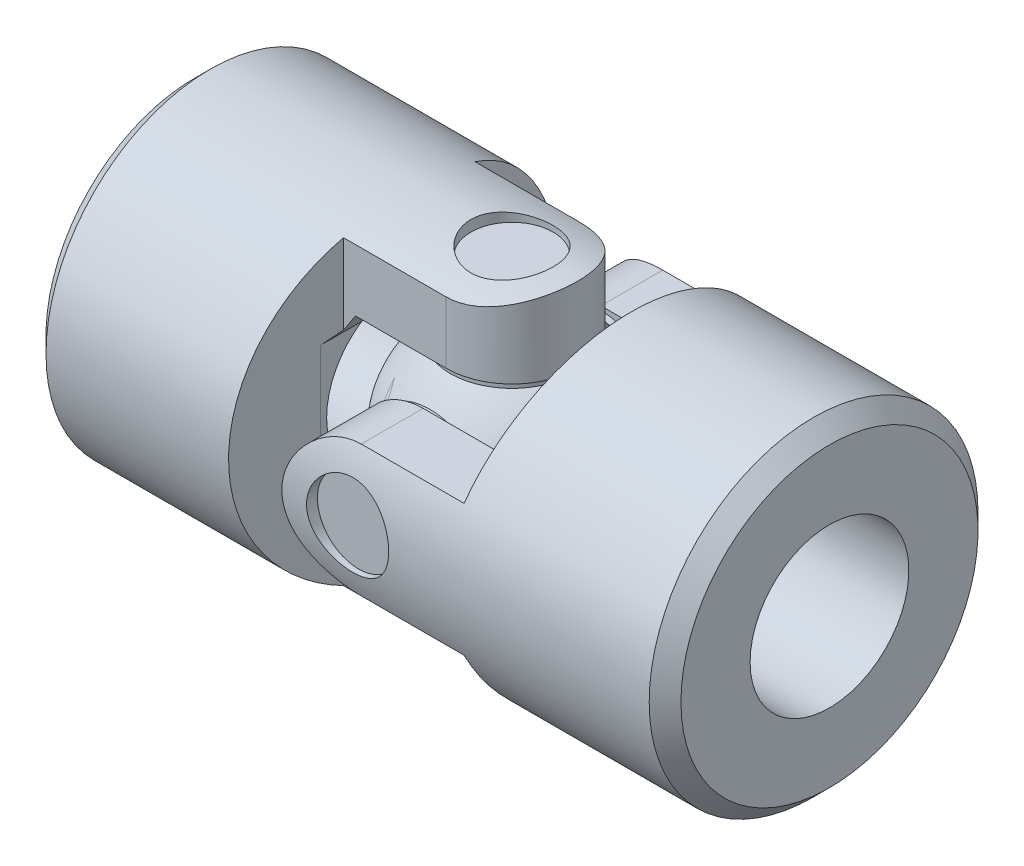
ISO-10303-21;
HEADER;
FILE_DESCRIPTION(('STEP AP214'),'2;1');
FILE_NAME('part.step','',(''),(''),'','','');
FILE_SCHEMA(('AUTOMOTIVE_DESIGN { 1 0 10303 214 1 1 1 1 }'));
ENDSEC;
DATA;
#1=APPLICATION_CONTEXT('core data for automotive mechanical design processes');
#2=APPLICATION_PROTOCOL_DEFINITION('international standard','automotive_design',2000,#1);
#3=PRODUCT_CONTEXT('',#1,'mechanical');
#4=PRODUCT('Part','Part','',(#3));
#5=PRODUCT_RELATED_PRODUCT_CATEGORY('part','',(#4));
#6=PRODUCT_DEFINITION_FORMATION('','',#4);
#7=PRODUCT_DEFINITION_CONTEXT('part definition',#1,'design');
#8=PRODUCT_DEFINITION('design','',#6,#7);
#9=PRODUCT_DEFINITION_SHAPE('','',#8);
#10=(LENGTH_UNIT() NAMED_UNIT(*) SI_UNIT(.MILLI.,.METRE.));
#11=(NAMED_UNIT(*) PLANE_ANGLE_UNIT() SI_UNIT($,.RADIAN.));
#12=(NAMED_UNIT(*) SI_UNIT($,.STERADIAN.) SOLID_ANGLE_UNIT());
#13=UNCERTAINTY_MEASURE_WITH_UNIT(LENGTH_MEASURE(1.E-05),#10,'distance_accuracy_value','');
#14=(GEOMETRIC_REPRESENTATION_CONTEXT(3) GLOBAL_UNCERTAINTY_ASSIGNED_CONTEXT((#13)) GLOBAL_UNIT_ASSIGNED_CONTEXT((#10,
#11,#12)) REPRESENTATION_CONTEXT('',''));
#15=CARTESIAN_POINT('',(0.,0.,0.));
#16=DIRECTION('',(0.,0.,1.));
#17=DIRECTION('',(1.,0.,0.));
#18=AXIS2_PLACEMENT_3D('',#15,#16,#17);
#19=CARTESIAN_POINT('',(22.5625,-7.25,-23.2768398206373));
#20=DIRECTION('',(0.,-1.,0.));
#21=DIRECTION('',(0.,0.,-1.));
#22=AXIS2_PLACEMENT_3D('',#19,#20,#21);
#23=PLANE('',#22);
#24=CARTESIAN_POINT('',(28.,-7.25,0.));
#25=DIRECTION('',(0.,-1.,0.));
#26=DIRECTION('',(0.,0.,-1.));
#27=AXIS2_PLACEMENT_3D('',#24,#25,#26);
#28=CIRCLE('',#27,5.4375);
#29=CARTESIAN_POINT('',(28.,-7.25,-5.4375));
#30=VERTEX_POINT('',#29);
#31=EDGE_CURVE('P0_E58',#30,#30,#28,.F.);
#32=ORIENTED_EDGE('',*,*,#31,.F.);
#33=EDGE_LOOP('',(#32));
#34=FACE_BOUND('',#33,.T.);
#35=CARTESIAN_POINT('',(28.,-7.25,0.));
#36=DIRECTION('',(0.,-1.,0.));
#37=DIRECTION('',(0.,0.,-1.));
#38=AXIS2_PLACEMENT_3D('',#35,#36,#37);
#39=CIRCLE('',#38,3.625);
#40=CARTESIAN_POINT('',(28.,-7.25,-3.625));
#41=VERTEX_POINT('',#40);
#42=EDGE_CURVE('P0_E80',#41,#41,#39,.F.);
#43=ORIENTED_EDGE('',*,*,#42,.T.);
#44=EDGE_LOOP('',(#43));
#45=FACE_BOUND('',#44,.T.);
#46=ADVANCED_FACE('P0_F29',(#34,#45),#23,.T.);
#47=CARTESIAN_POINT('',(22.5625,7.25,-23.2768398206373));
#48=DIRECTION('',(0.,1.,0.));
#49=DIRECTION('',(0.,0.,1.));
#50=AXIS2_PLACEMENT_3D('',#47,#48,#49);
#51=PLANE('',#50);
#52=CARTESIAN_POINT('',(28.,7.25,0.));
#53=DIRECTION('',(0.,1.,0.));
#54=DIRECTION('',(0.,0.,1.));
#55=AXIS2_PLACEMENT_3D('',#52,#53,#54);
#56=CIRCLE('',#55,5.4375);
#57=CARTESIAN_POINT('',(28.,7.25,5.4375));
#58=VERTEX_POINT('',#57);
#59=EDGE_CURVE('P0_E61',#58,#58,#56,.F.);
#60=ORIENTED_EDGE('',*,*,#59,.F.);
#61=EDGE_LOOP('',(#60));
#62=FACE_BOUND('',#61,.T.);
#63=CARTESIAN_POINT('',(28.,7.25,0.));
#64=DIRECTION('',(0.,1.,0.));
#65=DIRECTION('',(0.,0.,1.));
#66=AXIS2_PLACEMENT_3D('',#63,#64,#65);
#67=CIRCLE('',#66,3.625);
#68=CARTESIAN_POINT('',(28.,7.25,3.625));
#69=VERTEX_POINT('',#68);
#70=EDGE_CURVE('P0_E34',#69,#69,#67,.F.);
#71=ORIENTED_EDGE('',*,*,#70,.T.);
#72=EDGE_LOOP('',(#71));
#73=FACE_BOUND('',#72,.T.);
#74=ADVANCED_FACE('P0_F92',(#62,#73),#51,.T.);
#75=CARTESIAN_POINT('',(22.5625,-106.276839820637,-7.25));
#76=DIRECTION('',(0.,0.,-1.));
#77=DIRECTION('',(-1.,0.,0.));
#78=AXIS2_PLACEMENT_3D('',#75,#76,#77);
#79=PLANE('',#78);
#80=CARTESIAN_POINT('',(28.,0.,-7.25));
#81=DIRECTION('',(0.,0.,-1.));
#82=DIRECTION('',(-1.,0.,0.));
#83=AXIS2_PLACEMENT_3D('',#80,#81,#82);
#84=CIRCLE('',#83,5.4375);
#85=CARTESIAN_POINT('',(22.5625,0.,-7.25));
#86=VERTEX_POINT('',#85);
#87=EDGE_CURVE('P0_E11',#86,#86,#84,.T.);
#88=ORIENTED_EDGE('',*,*,#87,.T.);
#89=EDGE_LOOP('',(#88));
#90=FACE_BOUND('',#89,.T.);
#91=CARTESIAN_POINT('',(28.,0.,-7.25));
#92=DIRECTION('',(0.,0.,-1.));
#93=DIRECTION('',(-1.,0.,0.));
#94=AXIS2_PLACEMENT_3D('',#91,#92,#93);
#95=CIRCLE('',#94,3.625);
#96=CARTESIAN_POINT('',(24.375,0.,-7.25));
#97=VERTEX_POINT('',#96);
#98=EDGE_CURVE('P0_E63',#97,#97,#95,.F.);
#99=ORIENTED_EDGE('',*,*,#98,.T.);
#100=EDGE_LOOP('',(#99));
#101=FACE_BOUND('',#100,.T.);
#102=ADVANCED_FACE('P0_F86',(#90,#101),#79,.T.);
#103=CARTESIAN_POINT('',(33.4375,-106.276839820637,7.25));
#104=DIRECTION('',(0.,0.,1.));
#105=DIRECTION('',(1.,0.,0.));
#106=AXIS2_PLACEMENT_3D('',#103,#104,#105);
#107=PLANE('',#106);
#108=CARTESIAN_POINT('',(28.,0.,7.25));
#109=DIRECTION('',(0.,0.,1.));
#110=DIRECTION('',(1.,0.,0.));
#111=AXIS2_PLACEMENT_3D('',#108,#109,#110);
#112=CIRCLE('',#111,5.4375);
#113=CARTESIAN_POINT('',(33.4375,0.,7.25));
#114=VERTEX_POINT('',#113);
#115=EDGE_CURVE('P0_E39',#114,#114,#112,.T.);
#116=ORIENTED_EDGE('',*,*,#115,.T.);
#117=EDGE_LOOP('',(#116));
#118=FACE_BOUND('',#117,.T.);
#119=CARTESIAN_POINT('',(28.,0.,7.25));
#120=DIRECTION('',(0.,0.,1.));
#121=DIRECTION('',(1.,0.,0.));
#122=AXIS2_PLACEMENT_3D('',#119,#120,#121);
#123=CIRCLE('',#122,3.625);
#124=CARTESIAN_POINT('',(31.625,0.,7.25));
#125=VERTEX_POINT('',#124);
#126=EDGE_CURVE('P0_E67',#125,#125,#123,.F.);
#127=ORIENTED_EDGE('',*,*,#126,.T.);
#128=EDGE_LOOP('',(#127));
#129=FACE_BOUND('',#128,.T.);
#130=ADVANCED_FACE('P0_F49',(#118,#129),#107,.T.);
#131=CARTESIAN_POINT('',(28.,0.,0.));
#132=DIRECTION('',(1.,0.,0.));
#133=DIRECTION('',(0.,1.,0.));
#134=AXIS2_PLACEMENT_3D('',#131,#132,#133);
#135=SPHERICAL_SURFACE('',#134,9.0625);
#136=CARTESIAN_POINT('',(37.0625,0.,0.));
#137=VERTEX_POINT('',#136);
#138=VERTEX_LOOP('',#137);
#139=FACE_BOUND('',#138,.T.);
#140=ORIENTED_EDGE('',*,*,#87,.F.);
#141=EDGE_LOOP('',(#140));
#142=FACE_BOUND('',#141,.T.);
#143=CARTESIAN_POINT('',(18.9375,0.,0.));
#144=VERTEX_POINT('',#143);
#145=VERTEX_LOOP('',#144);
#146=FACE_BOUND('',#145,.T.);
#147=ORIENTED_EDGE('',*,*,#115,.F.);
#148=EDGE_LOOP('',(#147));
#149=FACE_BOUND('',#148,.T.);
#150=ORIENTED_EDGE('',*,*,#31,.T.);
#151=EDGE_LOOP('',(#150));
#152=FACE_BOUND('',#151,.T.);
#153=ORIENTED_EDGE('',*,*,#59,.T.);
#154=EDGE_LOOP('',(#153));
#155=FACE_BOUND('',#154,.T.);
#156=ADVANCED_FACE('P0_F31',(#139,#142,#146,#149,#152,#155),#135,.T.);
#157=CARTESIAN_POINT('',(28.,0.,13.5));
#158=DIRECTION('',(0.,0.,1.));
#159=DIRECTION('',(1.,0.,0.));
#160=AXIS2_PLACEMENT_3D('',#157,#158,#159);
#161=PLANE('',#160);
#162=CARTESIAN_POINT('',(28.,0.,13.5));
#163=DIRECTION('',(0.,0.,1.));
#164=DIRECTION('',(1.,0.,0.));
#165=AXIS2_PLACEMENT_3D('',#162,#163,#164);
#166=CIRCLE('',#165,3.625);
#167=CARTESIAN_POINT('',(31.625,0.,13.5));
#168=VERTEX_POINT('',#167);
#169=EDGE_CURVE('P0_E71',#168,#168,#166,.T.);
#170=ORIENTED_EDGE('',*,*,#169,.T.);
#171=EDGE_LOOP('',(#170));
#172=FACE_BOUND('',#171,.T.);
#173=ADVANCED_FACE('P0_F48',(#172),#161,.T.);
#174=CARTESIAN_POINT('',(28.,0.,13.5));
#175=DIRECTION('',(0.,0.,-1.));
#176=DIRECTION('',(-1.,0.,0.));
#177=AXIS2_PLACEMENT_3D('',#174,#175,#176);
#178=CYLINDRICAL_SURFACE('',#177,3.625);
#179=ORIENTED_EDGE('',*,*,#126,.F.);
#180=EDGE_LOOP('',(#179));
#181=FACE_BOUND('',#180,.T.);
#182=ORIENTED_EDGE('',*,*,#169,.F.);
#183=EDGE_LOOP('',(#182));
#184=FACE_BOUND('',#183,.T.);
#185=ADVANCED_FACE('P0_F137',(#181,#184),#178,.T.);
#186=ORIENTED_EDGE('',*,*,#98,.F.);
#187=EDGE_LOOP('',(#186));
#188=FACE_BOUND('',#187,.T.);
#189=CARTESIAN_POINT('',(28.,0.,-13.5));
#190=DIRECTION('',(0.,0.,1.));
#191=DIRECTION('',(1.,0.,0.));
#192=AXIS2_PLACEMENT_3D('',#189,#190,#191);
#193=CIRCLE('',#192,3.625);
#194=CARTESIAN_POINT('',(31.625,0.,-13.5));
#195=VERTEX_POINT('',#194);
#196=EDGE_CURVE('P0_E75',#195,#195,#193,.T.);
#197=ORIENTED_EDGE('',*,*,#196,.T.);
#198=EDGE_LOOP('',(#197));
#199=FACE_BOUND('',#198,.T.);
#200=ADVANCED_FACE('P0_F135',(#188,#199),#178,.T.);
#201=CARTESIAN_POINT('',(28.,0.,-13.5));
#202=DIRECTION('',(0.,0.,1.));
#203=DIRECTION('',(1.,0.,0.));
#204=AXIS2_PLACEMENT_3D('',#201,#202,#203);
#205=PLANE('',#204);
#206=ORIENTED_EDGE('',*,*,#196,.F.);
#207=EDGE_LOOP('',(#206));
#208=FACE_BOUND('',#207,.T.);
#209=ADVANCED_FACE('P0_F129',(#208),#205,.F.);
#210=CARTESIAN_POINT('',(28.,13.5,0.));
#211=DIRECTION('',(0.,1.,0.));
#212=DIRECTION('',(0.,0.,1.));
#213=AXIS2_PLACEMENT_3D('',#210,#211,#212);
#214=PLANE('',#213);
#215=CARTESIAN_POINT('',(28.,13.5,0.));
#216=DIRECTION('',(0.,1.,0.));
#217=DIRECTION('',(0.,0.,1.));
#218=AXIS2_PLACEMENT_3D('',#215,#216,#217);
#219=CIRCLE('',#218,3.625);
#220=CARTESIAN_POINT('',(28.,13.5,3.625));
#221=VERTEX_POINT('',#220);
#222=EDGE_CURVE('P0_E108',#221,#221,#219,.T.);
#223=ORIENTED_EDGE('',*,*,#222,.T.);
#224=EDGE_LOOP('',(#223));
#225=FACE_BOUND('',#224,.T.);
#226=ADVANCED_FACE('P0_F127',(#225),#214,.T.);
#227=CARTESIAN_POINT('',(28.,13.5,0.));
#228=DIRECTION('',(0.,-1.,0.));
#229=DIRECTION('',(0.,0.,-1.));
#230=AXIS2_PLACEMENT_3D('',#227,#228,#229);
#231=CYLINDRICAL_SURFACE('',#230,3.625);
#232=ORIENTED_EDGE('',*,*,#70,.F.);
#233=EDGE_LOOP('',(#232));
#234=FACE_BOUND('',#233,.T.);
#235=ORIENTED_EDGE('',*,*,#222,.F.);
#236=EDGE_LOOP('',(#235));
#237=FACE_BOUND('',#236,.T.);
#238=ADVANCED_FACE('P0_F124',(#234,#237),#231,.T.);
#239=ORIENTED_EDGE('',*,*,#42,.F.);
#240=EDGE_LOOP('',(#239));
#241=FACE_BOUND('',#240,.T.);
#242=CARTESIAN_POINT('',(28.,-13.5,0.));
#243=DIRECTION('',(0.,1.,0.));
#244=DIRECTION('',(0.,0.,1.));
#245=AXIS2_PLACEMENT_3D('',#242,#243,#244);
#246=CIRCLE('',#245,3.625);
#247=CARTESIAN_POINT('',(28.,-13.5,3.625));
#248=VERTEX_POINT('',#247);
#249=EDGE_CURVE('P0_E112',#248,#248,#246,.T.);
#250=ORIENTED_EDGE('',*,*,#249,.T.);
#251=EDGE_LOOP('',(#250));
#252=FACE_BOUND('',#251,.T.);
#253=ADVANCED_FACE('P0_F116',(#241,#252),#231,.T.);
#254=CARTESIAN_POINT('',(28.,-13.5,0.));
#255=DIRECTION('',(0.,1.,0.));
#256=DIRECTION('',(0.,0.,1.));
#257=AXIS2_PLACEMENT_3D('',#254,#255,#256);
#258=PLANE('',#257);
#259=ORIENTED_EDGE('',*,*,#249,.F.);
#260=EDGE_LOOP('',(#259));
#261=FACE_BOUND('',#260,.T.);
#262=ADVANCED_FACE('P0_F118',(#261),#258,.F.);
#263=CLOSED_SHELL('',(#46,#74,#102,#130,#156,#173,#185,#200,#209,#226,#238,#253,#262));
#264=MANIFOLD_SOLID_BREP('P0_B2',#263);
#265=CARTESIAN_POINT('',(28.,13.5333333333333,0.));
#266=DIRECTION('',(0.,1.,0.));
#267=DIRECTION('',(0.,0.,1.));
#268=AXIS2_PLACEMENT_3D('',#265,#266,#267);
#269=PLANE('',#268);
#270=CARTESIAN_POINT('',(28.,13.5333333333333,0.));
#271=DIRECTION('',(0.,1.,0.));
#272=DIRECTION('',(0.,0.,1.));
#273=AXIS2_PLACEMENT_3D('',#270,#271,#272);
#274=CIRCLE('',#273,3.625);
#275=CARTESIAN_POINT('',(28.,13.5333333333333,3.625));
#276=VERTEX_POINT('',#275);
#277=EDGE_CURVE('P1_E21',#276,#276,#274,.T.);
#278=ORIENTED_EDGE('',*,*,#277,.T.);
#279=EDGE_LOOP('',(#278));
#280=FACE_BOUND('',#279,.T.);
#281=ADVANCED_FACE('P1_F16',(#280),#269,.T.);
#282=CARTESIAN_POINT('',(28.,-13.5333333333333,0.));
#283=DIRECTION('',(0.,-1.,0.));
#284=DIRECTION('',(0.,0.,-1.));
#285=AXIS2_PLACEMENT_3D('',#282,#283,#284);
#286=PLANE('',#285);
#287=CARTESIAN_POINT('',(28.,-13.5333333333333,0.));
#288=DIRECTION('',(0.,-1.,0.));
#289=DIRECTION('',(0.,0.,-1.));
#290=AXIS2_PLACEMENT_3D('',#287,#288,#289);
#291=CIRCLE('',#290,3.625);
#292=CARTESIAN_POINT('',(28.,-13.5333333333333,-3.625));
#293=VERTEX_POINT('',#292);
#294=EDGE_CURVE('P1_E406',#293,#293,#291,.T.);
#295=ORIENTED_EDGE('',*,*,#294,.T.);
#296=EDGE_LOOP('',(#295));
#297=FACE_BOUND('',#296,.T.);
#298=ADVANCED_FACE('P1_F414',(#297),#286,.T.);
#299=CARTESIAN_POINT('',(28.,16.5166666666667,0.));
#300=DIRECTION('',(0.,1.,0.));
#301=DIRECTION('',(0.,0.,1.));
#302=AXIS2_PLACEMENT_3D('',#299,#300,#301);
#303=CYLINDRICAL_SURFACE('',#302,3.625);
#304=ORIENTED_EDGE('',*,*,#277,.F.);
#305=EDGE_LOOP('',(#304));
#306=FACE_BOUND('',#305,.T.);
#307=CARTESIAN_POINT('',(24.375,14.5,0.));
#308=CARTESIAN_POINT('',(24.3750086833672,14.4999948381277,-0.200213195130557));
#309=CARTESIAN_POINT('',(24.3916485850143,14.4958102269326,-0.400541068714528));
#310=CARTESIAN_POINT('',(24.4576899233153,14.4795147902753,-0.795510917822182));
#311=CARTESIAN_POINT('',(24.507123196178,14.4673962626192,-0.990147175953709));
#312=CARTESIAN_POINT('',(24.6370644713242,14.4365768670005,-1.36788958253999));
#313=CARTESIAN_POINT('',(24.7175301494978,14.4178849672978,-1.55101104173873));
#314=CARTESIAN_POINT('',(24.9071140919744,14.375910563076,-1.90113886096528));
#315=CARTESIAN_POINT('',(25.0162309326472,14.3526282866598,-2.0681460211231));
#316=CARTESIAN_POINT('',(25.2624010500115,14.3034626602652,-2.38477004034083));
#317=CARTESIAN_POINT('',(25.3999343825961,14.2775391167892,-2.53400745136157));
#318=CARTESIAN_POINT('',(25.6980072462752,14.2262795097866,-2.80755821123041));
#319=CARTESIAN_POINT('',(25.8585496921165,14.2009435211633,-2.93186839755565));
#320=CARTESIAN_POINT('',(26.2010219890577,14.1533237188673,-3.15381425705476));
#321=CARTESIAN_POINT('',(26.3832340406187,14.1310908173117,-3.25102639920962));
#322=CARTESIAN_POINT('',(26.7620590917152,14.0927794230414,-3.41329267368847));
#323=CARTESIAN_POINT('',(26.9586697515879,14.0766999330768,-3.47835201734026));
#324=CARTESIAN_POINT('',(27.3565466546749,14.0529281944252,-3.57317415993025));
#325=CARTESIAN_POINT('',(27.5576407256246,14.0450743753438,-3.60361795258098));
#326=CARTESIAN_POINT('',(27.9622237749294,14.0381595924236,-3.63046594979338));
#327=CARTESIAN_POINT('',(28.165712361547,14.0390972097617,-3.62687564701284));
#328=CARTESIAN_POINT('',(28.5640875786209,14.0495141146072,-3.58630087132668));
#329=CARTESIAN_POINT('',(28.7590631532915,14.0587857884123,-3.55012803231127));
#330=CARTESIAN_POINT('',(29.1400881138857,14.0844953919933,-3.44670871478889));
#331=CARTESIAN_POINT('',(29.3261368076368,14.1009338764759,-3.37945983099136));
#332=CARTESIAN_POINT('',(29.6862060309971,14.1393158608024,-3.21510571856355));
#333=CARTESIAN_POINT('',(29.8600857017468,14.161313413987,-3.11770508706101));
#334=CARTESIAN_POINT('',(30.1893148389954,14.2083031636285,-2.89601715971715));
#335=CARTESIAN_POINT('',(30.3446622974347,14.2332956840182,-2.77172695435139));
#336=CARTESIAN_POINT('',(30.6370424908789,14.2843280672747,-2.49563956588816));
#337=CARTESIAN_POINT('',(30.7734313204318,14.3103775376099,-2.34316258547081));
#338=CARTESIAN_POINT('',(31.0189201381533,14.3599701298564,-2.01701682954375));
#339=CARTESIAN_POINT('',(31.1280083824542,14.3835121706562,-1.8433389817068));
#340=CARTESIAN_POINT('',(31.2688307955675,14.4150110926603,-1.57034031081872));
#341=CARTESIAN_POINT('',(31.3120536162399,14.4248960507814,-1.4769973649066));
#342=CARTESIAN_POINT('',(31.3904542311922,14.4430985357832,-1.28685656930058));
#343=CARTESIAN_POINT('',(31.4256352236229,14.4514166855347,-1.19006011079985));
#344=CARTESIAN_POINT('',(31.4876106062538,14.4662330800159,-0.993865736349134));
#345=CARTESIAN_POINT('',(31.5144186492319,14.4727342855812,-0.894472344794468));
#346=CARTESIAN_POINT('',(31.5594920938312,14.4837453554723,-0.693698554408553));
#347=CARTESIAN_POINT('',(31.5777614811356,14.4882561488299,-0.592319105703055));
#348=CARTESIAN_POINT('',(31.6027706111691,14.4944547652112,-0.409129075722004));
#349=CARTESIAN_POINT('',(31.6111020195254,14.4965307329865,-0.32754500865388));
#350=CARTESIAN_POINT('',(31.6222171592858,14.4993035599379,-0.163976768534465));
#351=CARTESIAN_POINT('',(31.6250008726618,14.5000004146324,-0.0819925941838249));
#352=CARTESIAN_POINT('',(31.6249989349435,14.4999994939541,0.100069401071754));
#353=CARTESIAN_POINT('',(31.6208501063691,14.4989603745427,0.20015134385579));
#354=CARTESIAN_POINT('',(31.6043002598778,14.4948372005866,0.39960044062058));
#355=CARTESIAN_POINT('',(31.5918955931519,14.4917522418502,0.498967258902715));
#356=CARTESIAN_POINT('',(31.5423600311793,14.4795222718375,0.79519260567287));
#357=CARTESIAN_POINT('',(31.4929077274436,14.4674023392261,0.990023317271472));
#358=CARTESIAN_POINT('',(31.3629265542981,14.4365759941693,1.36794957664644));
#359=CARTESIAN_POINT('',(31.2824505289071,14.4178807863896,1.55106446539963));
#360=CARTESIAN_POINT('',(31.0928603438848,14.3759048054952,1.90116833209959));
#361=CARTESIAN_POINT('',(30.9837543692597,14.3526253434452,2.0681619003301));
#362=CARTESIAN_POINT('',(30.7376138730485,14.303465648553,2.38475392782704));
#363=CARTESIAN_POINT('',(30.600099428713,14.2775452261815,2.53397284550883));
#364=CARTESIAN_POINT('',(30.3020292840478,14.226285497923,2.80752826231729));
#365=CARTESIAN_POINT('',(30.1414652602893,14.2009464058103,2.93185573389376));
#366=CARTESIAN_POINT('',(29.798895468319,14.1533114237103,3.15387076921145));
#367=CARTESIAN_POINT('',(29.6166001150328,14.131067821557,3.25112327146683));
#368=CARTESIAN_POINT('',(29.2377203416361,14.0927633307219,3.41336132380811));
#369=CARTESIAN_POINT('',(29.0411530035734,14.0766951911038,3.47838474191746));
#370=CARTESIAN_POINT('',(28.7029942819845,14.0564815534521,3.55899085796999));
#371=CARTESIAN_POINT('',(28.5636398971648,14.0501734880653,3.5837015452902));
#372=CARTESIAN_POINT('',(28.2828761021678,14.0417130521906,3.61670890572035));
#373=CARTESIAN_POINT('',(28.141466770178,14.0395605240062,3.6250062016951));
#374=CARTESIAN_POINT('',(27.7998969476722,14.0395704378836,3.62499122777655));
#375=CARTESIAN_POINT('',(27.5996789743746,14.0438911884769,3.6083690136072));
#376=CARTESIAN_POINT('',(27.2049376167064,14.0606714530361,3.54240427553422));
#377=CARTESIAN_POINT('',(27.010420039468,14.0731389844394,3.49302951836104));
#378=CARTESIAN_POINT('',(26.6329265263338,14.1047125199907,3.36325844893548));
#379=CARTESIAN_POINT('',(26.4499344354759,14.1238089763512,3.28290673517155));
#380=CARTESIAN_POINT('',(26.1000301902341,14.1664763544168,3.09359355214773));
#381=CARTESIAN_POINT('',(25.9331169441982,14.1900469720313,2.98463402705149));
#382=CARTESIAN_POINT('',(25.6164174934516,14.2395877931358,2.73864052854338));
#383=CARTESIAN_POINT('',(25.4670356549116,14.2655962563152,2.60109358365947));
#384=CARTESIAN_POINT('',(25.1931718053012,14.3167564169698,2.30289618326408));
#385=CARTESIAN_POINT('',(25.0686973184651,14.3419078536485,2.14223877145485));
#386=CARTESIAN_POINT('',(24.8465197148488,14.3889480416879,1.79957868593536));
#387=CARTESIAN_POINT('',(24.7492266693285,14.410784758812,1.61730264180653));
#388=CARTESIAN_POINT('',(24.586907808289,14.4482624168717,1.23846283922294));
#389=CARTESIAN_POINT('',(24.5218448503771,14.4639104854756,1.04191582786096));
#390=CARTESIAN_POINT('',(24.4411336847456,14.4835749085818,0.703653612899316));
#391=CARTESIAN_POINT('',(24.416375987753,14.4897025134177,0.564166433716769));
#392=CARTESIAN_POINT('',(24.3833063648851,14.4979168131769,0.283138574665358));
#393=CARTESIAN_POINT('',(24.3749938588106,14.5000036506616,0.141597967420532));
#394=CARTESIAN_POINT('',(24.375,14.5,0.));
#395=B_SPLINE_CURVE_WITH_KNOTS('',3,(#307,#308,#309,#310,#311,#312,#313,#314,#315,#316,#317,
#318,#319,#320,#321,#322,#323,#324,#325,#326,#327,#328,#329,#330,#331,#332,#333,#334,#335,#336,
#337,#338,#339,#340,#341,#342,#343,#344,#345,#346,#347,#348,#349,#350,#351,#352,#353,#354,#355,
#356,#357,#358,#359,#360,#361,#362,#363,#364,#365,#366,#367,#368,#369,#370,#371,#372,#373,#374,
#375,#376,#377,#378,#379,#380,#381,#382,#383,#384,#385,#386,#387,#388,#389,#390,#391,#392,#393,
#394),.UNSPECIFIED.,.T.,.F.,(4,2,2,2,2,2,2,2,2,2,2,2,2,2,2,2,2,2,2,2,2,2,2,2,2,2,2,2,2,2,2,2,2,
2,2,2,2,2,2,2,2,2,2,4),(0.,0.600114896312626,1.20081324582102,1.80069520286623,2.40054735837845,
3.01151126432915,3.6225526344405,4.2426679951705,4.86268281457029,5.47027673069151,
6.07777259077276,6.67054185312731,7.26335700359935,7.86217443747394,8.46105669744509,
9.07691344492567,9.69303466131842,10.002734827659,10.3123116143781,10.6213809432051,
10.9303058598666,11.1762163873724,11.4221277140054,11.7222548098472,12.0225146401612,
12.6234865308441,13.2234392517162,13.8232206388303,14.4341126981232,15.0452259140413,
15.6656563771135,16.2853561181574,16.7094011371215,17.1334300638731,17.7332139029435,
18.3335888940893,18.9331027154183,19.5325758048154,20.1439137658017,20.7554361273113,
21.3757392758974,21.9953259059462,22.4197637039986,22.8441865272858),.UNSPECIFIED.);
#396=CARTESIAN_POINT('',(24.375,14.5,0.));
#397=VERTEX_POINT('',#396);
#398=EDGE_CURVE('P1_E398',#397,#397,#395,.T.);
#399=ORIENTED_EDGE('',*,*,#398,.F.);
#400=EDGE_LOOP('',(#399));
#401=FACE_BOUND('',#400,.T.);
#402=ADVANCED_FACE('P1_F408',(#306,#401),#303,.F.);
#403=CARTESIAN_POINT('',(0.,0.,-6.55));
#404=DIRECTION('',(-1.,0.,0.));
#405=DIRECTION('',(0.,0.,1.));
#406=AXIS2_PLACEMENT_3D('',#403,#404,#405);
#407=PLANE('',#406);
#408=CARTESIAN_POINT('',(0.,0.,0.));
#409=DIRECTION('',(1.,0.,0.));
#410=DIRECTION('',(0.,0.,-1.));
#411=AXIS2_PLACEMENT_3D('',#408,#409,#410);
#412=CIRCLE('',#411,13.1);
#413=CARTESIAN_POINT('',(0.,0.,-13.1));
#414=VERTEX_POINT('',#413);
#415=EDGE_CURVE('P1_E873',#414,#414,#412,.T.);
#416=ORIENTED_EDGE('',*,*,#415,.F.);
#417=EDGE_LOOP('',(#416));
#418=FACE_BOUND('',#417,.T.);
#419=CARTESIAN_POINT('',(0.,0.,0.));
#420=DIRECTION('',(1.,0.,0.));
#421=DIRECTION('',(0.,0.,-1.));
#422=AXIS2_PLACEMENT_3D('',#419,#420,#421);
#423=CIRCLE('',#422,7.);
#424=CARTESIAN_POINT('',(0.,0.,-7.));
#425=VERTEX_POINT('',#424);
#426=EDGE_CURVE('P1_E405',#425,#425,#423,.T.);
#427=ORIENTED_EDGE('',*,*,#426,.T.);
#428=EDGE_LOOP('',(#427));
#429=FACE_BOUND('',#428,.T.);
#430=ADVANCED_FACE('P1_F413',(#418,#429),#407,.T.);
#431=CARTESIAN_POINT('',(1.4,0.,0.));
#432=DIRECTION('',(1.,0.,0.));
#433=DIRECTION('',(0.,0.,-1.));
#434=AXIS2_PLACEMENT_3D('',#431,#432,#433);
#435=CONICAL_SURFACE('',#434,14.5,0.785398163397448);
#436=CARTESIAN_POINT('',(1.4,0.,0.));
#437=DIRECTION('',(1.,0.,0.));
#438=DIRECTION('',(0.,0.,-1.));
#439=AXIS2_PLACEMENT_3D('',#436,#437,#438);
#440=CIRCLE('',#439,14.5);
#441=CARTESIAN_POINT('',(1.4,0.,-14.5));
#442=VERTEX_POINT('',#441);
#443=EDGE_CURVE('P1_E655',#442,#442,#440,.T.);
#444=ORIENTED_EDGE('',*,*,#443,.F.);
#445=EDGE_LOOP('',(#444));
#446=FACE_BOUND('',#445,.T.);
#447=ORIENTED_EDGE('',*,*,#415,.T.);
#448=EDGE_LOOP('',(#447));
#449=FACE_BOUND('',#448,.T.);
#450=ADVANCED_FACE('P1_F419',(#446,#449),#435,.T.);
#451=CARTESIAN_POINT('',(28.,-16.5166666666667,0.));
#452=DIRECTION('',(0.,-1.,0.));
#453=DIRECTION('',(0.,0.,-1.));
#454=AXIS2_PLACEMENT_3D('',#451,#452,#453);
#455=CYLINDRICAL_SURFACE('',#454,3.625);
#456=ORIENTED_EDGE('',*,*,#294,.F.);
#457=EDGE_LOOP('',(#456));
#458=FACE_BOUND('',#457,.T.);
#459=CARTESIAN_POINT('',(24.375,-14.5,0.));
#460=CARTESIAN_POINT('',(24.3750086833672,-14.4999948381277,0.200213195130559));
#461=CARTESIAN_POINT('',(24.3916485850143,-14.4958102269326,0.40054106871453));
#462=CARTESIAN_POINT('',(24.4576899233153,-14.4795147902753,0.795510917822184));
#463=CARTESIAN_POINT('',(24.507123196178,-14.4673962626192,0.990147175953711));
#464=CARTESIAN_POINT('',(24.6370644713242,-14.4365768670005,1.36788958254));
#465=CARTESIAN_POINT('',(24.7175301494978,-14.4178849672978,1.55101104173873));
#466=CARTESIAN_POINT('',(24.9071140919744,-14.375910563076,1.90113886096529));
#467=CARTESIAN_POINT('',(25.0162309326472,-14.3526282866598,2.0681460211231));
#468=CARTESIAN_POINT('',(25.2624010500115,-14.3034626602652,2.38477004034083));
#469=CARTESIAN_POINT('',(25.3999343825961,-14.2775391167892,2.53400745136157));
#470=CARTESIAN_POINT('',(25.6980072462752,-14.2262795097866,2.80755821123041));
#471=CARTESIAN_POINT('',(25.8585496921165,-14.2009435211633,2.93186839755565));
#472=CARTESIAN_POINT('',(26.2010219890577,-14.1533237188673,3.15381425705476));
#473=CARTESIAN_POINT('',(26.3832340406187,-14.1310908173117,3.25102639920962));
#474=CARTESIAN_POINT('',(26.7620590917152,-14.0927794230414,3.41329267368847));
#475=CARTESIAN_POINT('',(26.9586697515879,-14.0766999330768,3.47835201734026));
#476=CARTESIAN_POINT('',(27.356546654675,-14.0529281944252,3.57317415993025));
#477=CARTESIAN_POINT('',(27.5576407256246,-14.0450743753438,3.60361795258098));
#478=CARTESIAN_POINT('',(27.9622237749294,-14.0381595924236,3.63046594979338));
#479=CARTESIAN_POINT('',(28.165712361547,-14.0390972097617,3.62687564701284));
#480=CARTESIAN_POINT('',(28.5640875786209,-14.0495141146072,3.58630087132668));
#481=CARTESIAN_POINT('',(28.7590631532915,-14.0587857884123,3.55012803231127));
#482=CARTESIAN_POINT('',(29.1400881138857,-14.0844953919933,3.44670871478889));
#483=CARTESIAN_POINT('',(29.3261368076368,-14.1009338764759,3.37945983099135));
#484=CARTESIAN_POINT('',(29.6862060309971,-14.1393158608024,3.21510571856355));
#485=CARTESIAN_POINT('',(29.8600857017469,-14.161313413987,3.11770508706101));
#486=CARTESIAN_POINT('',(30.1893148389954,-14.2083031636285,2.89601715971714));
#487=CARTESIAN_POINT('',(30.3446622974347,-14.2332956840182,2.77172695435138));
#488=CARTESIAN_POINT('',(30.6370424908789,-14.2843280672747,2.49563956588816));
#489=CARTESIAN_POINT('',(30.7734313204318,-14.3103775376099,2.34316258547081));
#490=CARTESIAN_POINT('',(31.0189201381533,-14.3599701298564,2.01701682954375));
#491=CARTESIAN_POINT('',(31.1280083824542,-14.3835121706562,1.8433389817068));
#492=CARTESIAN_POINT('',(31.2688307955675,-14.4150110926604,1.57034031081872));
#493=CARTESIAN_POINT('',(31.3120536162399,-14.4248960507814,1.4769973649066));
#494=CARTESIAN_POINT('',(31.3904542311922,-14.4430985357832,1.28685656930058));
#495=CARTESIAN_POINT('',(31.4256352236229,-14.4514166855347,1.19006011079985));
#496=CARTESIAN_POINT('',(31.4876106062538,-14.4662330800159,0.993865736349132));
#497=CARTESIAN_POINT('',(31.5144186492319,-14.4727342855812,0.894472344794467));
#498=CARTESIAN_POINT('',(31.5594920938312,-14.4837453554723,0.693698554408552));
#499=CARTESIAN_POINT('',(31.5777614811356,-14.4882561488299,0.592319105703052));
#500=CARTESIAN_POINT('',(31.6027706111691,-14.4944547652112,0.409129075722));
#501=CARTESIAN_POINT('',(31.6111020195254,-14.4965307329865,0.327545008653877));
#502=CARTESIAN_POINT('',(31.6222171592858,-14.4993035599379,0.163976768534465));
#503=CARTESIAN_POINT('',(31.6250008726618,-14.5000004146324,0.081992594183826));
#504=CARTESIAN_POINT('',(31.6249989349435,-14.4999994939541,-0.100069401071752));
#505=CARTESIAN_POINT('',(31.6208501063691,-14.4989603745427,-0.200151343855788));
#506=CARTESIAN_POINT('',(31.6043002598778,-14.4948372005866,-0.399600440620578));
#507=CARTESIAN_POINT('',(31.5918955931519,-14.4917522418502,-0.498967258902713));
#508=CARTESIAN_POINT('',(31.5423600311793,-14.4795222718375,-0.795192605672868));
#509=CARTESIAN_POINT('',(31.4929077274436,-14.4674023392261,-0.99002331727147));
#510=CARTESIAN_POINT('',(31.3629265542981,-14.4365759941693,-1.36794957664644));
#511=CARTESIAN_POINT('',(31.2824505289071,-14.4178807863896,-1.55106446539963));
#512=CARTESIAN_POINT('',(31.0928603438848,-14.3759048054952,-1.90116833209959));
#513=CARTESIAN_POINT('',(30.9837543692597,-14.3526253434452,-2.06816190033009));
#514=CARTESIAN_POINT('',(30.7376138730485,-14.303465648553,-2.38475392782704));
#515=CARTESIAN_POINT('',(30.600099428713,-14.2775452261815,-2.53397284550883));
#516=CARTESIAN_POINT('',(30.3020292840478,-14.226285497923,-2.80752826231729));
#517=CARTESIAN_POINT('',(30.1414652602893,-14.2009464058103,-2.93185573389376));
#518=CARTESIAN_POINT('',(29.798895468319,-14.1533114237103,-3.15387076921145));
#519=CARTESIAN_POINT('',(29.6166001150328,-14.131067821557,-3.25112327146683));
#520=CARTESIAN_POINT('',(29.2377203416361,-14.0927633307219,-3.41336132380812));
#521=CARTESIAN_POINT('',(29.0411530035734,-14.0766951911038,-3.47838474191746));
#522=CARTESIAN_POINT('',(28.7029942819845,-14.0564815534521,-3.55899085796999));
#523=CARTESIAN_POINT('',(28.5636398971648,-14.0501734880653,-3.5837015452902));
#524=CARTESIAN_POINT('',(28.2828761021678,-14.0417130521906,-3.61670890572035));
#525=CARTESIAN_POINT('',(28.141466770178,-14.0395605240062,-3.6250062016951));
#526=CARTESIAN_POINT('',(27.7998969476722,-14.0395704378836,-3.62499122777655));
#527=CARTESIAN_POINT('',(27.5996789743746,-14.0438911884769,-3.6083690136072));
#528=CARTESIAN_POINT('',(27.2049376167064,-14.0606714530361,-3.54240427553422));
#529=CARTESIAN_POINT('',(27.010420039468,-14.0731389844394,-3.49302951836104));
#530=CARTESIAN_POINT('',(26.6329265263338,-14.1047125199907,-3.36325844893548));
#531=CARTESIAN_POINT('',(26.4499344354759,-14.1238089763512,-3.28290673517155));
#532=CARTESIAN_POINT('',(26.1000301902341,-14.1664763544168,-3.09359355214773));
#533=CARTESIAN_POINT('',(25.9331169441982,-14.1900469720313,-2.98463402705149));
#534=CARTESIAN_POINT('',(25.6164174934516,-14.2395877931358,-2.73864052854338));
#535=CARTESIAN_POINT('',(25.4670356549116,-14.2655962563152,-2.60109358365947));
#536=CARTESIAN_POINT('',(25.1931718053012,-14.3167564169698,-2.30289618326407));
#537=CARTESIAN_POINT('',(25.0686973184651,-14.3419078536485,-2.14223877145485));
#538=CARTESIAN_POINT('',(24.8465197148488,-14.3889480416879,-1.79957868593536));
#539=CARTESIAN_POINT('',(24.7492266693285,-14.410784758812,-1.61730264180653));
#540=CARTESIAN_POINT('',(24.586907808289,-14.4482624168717,-1.23846283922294));
#541=CARTESIAN_POINT('',(24.5218448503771,-14.4639104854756,-1.04191582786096));
#542=CARTESIAN_POINT('',(24.4411336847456,-14.4835749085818,-0.703653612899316));
#543=CARTESIAN_POINT('',(24.416375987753,-14.4897025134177,-0.564166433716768));
#544=CARTESIAN_POINT('',(24.3833063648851,-14.4979168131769,-0.283138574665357));
#545=CARTESIAN_POINT('',(24.3749938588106,-14.5000036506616,-0.14159796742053));
#546=CARTESIAN_POINT('',(24.375,-14.5,0.));
#547=B_SPLINE_CURVE_WITH_KNOTS('',3,(#459,#460,#461,#462,#463,#464,#465,#466,#467,#468,#469,
#470,#471,#472,#473,#474,#475,#476,#477,#478,#479,#480,#481,#482,#483,#484,#485,#486,#487,#488,
#489,#490,#491,#492,#493,#494,#495,#496,#497,#498,#499,#500,#501,#502,#503,#504,#505,#506,#507,
#508,#509,#510,#511,#512,#513,#514,#515,#516,#517,#518,#519,#520,#521,#522,#523,#524,#525,#526,
#527,#528,#529,#530,#531,#532,#533,#534,#535,#536,#537,#538,#539,#540,#541,#542,#543,#544,#545,
#546),.UNSPECIFIED.,.T.,.F.,(4,2,2,2,2,2,2,2,2,2,2,2,2,2,2,2,2,2,2,2,2,2,2,2,2,2,2,2,2,2,2,2,2,
2,2,2,2,2,2,2,2,2,2,4),(0.,0.600114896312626,1.20081324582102,1.80069520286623,2.40054735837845,
3.01151126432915,3.6225526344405,4.24266799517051,4.86268281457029,5.47027673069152,
6.07777259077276,6.67054185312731,7.26335700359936,7.86217443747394,8.46105669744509,
9.07691344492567,9.69303466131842,10.002734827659,10.3123116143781,10.6213809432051,
10.9303058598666,11.1762163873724,11.4221277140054,11.7222548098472,12.0225146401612,
12.6234865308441,13.2234392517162,13.8232206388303,14.4341126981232,15.0452259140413,
15.6656563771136,16.2853561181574,16.7094011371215,17.1334300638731,17.7332139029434,
18.3335888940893,18.9331027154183,19.5325758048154,20.1439137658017,20.7554361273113,
21.3757392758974,21.9953259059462,22.4197637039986,22.8441865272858),.UNSPECIFIED.);
#548=CARTESIAN_POINT('',(24.375,-14.5,0.));
#549=VERTEX_POINT('',#548);
#550=EDGE_CURVE('P1_E386',#549,#549,#547,.T.);
#551=ORIENTED_EDGE('',*,*,#550,.F.);
#552=EDGE_LOOP('',(#551));
#553=FACE_BOUND('',#552,.T.);
#554=ADVANCED_FACE('P1_F422',(#458,#553),#455,.F.);
#555=CARTESIAN_POINT('',(18.6527272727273,0.,-29.));
#556=DIRECTION('',(-1.,0.,0.));
#557=DIRECTION('',(0.,0.,1.));
#558=AXIS2_PLACEMENT_3D('',#555,#556,#557);
#559=PLANE('',#558);
#560=CARTESIAN_POINT('',(18.6527272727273,0.,0.));
#561=DIRECTION('',(1.,0.,0.));
#562=DIRECTION('',(0.,0.,-1.));
#563=AXIS2_PLACEMENT_3D('',#560,#561,#562);
#564=CIRCLE('',#563,7.);
#565=CARTESIAN_POINT('',(18.6527272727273,-5.8,3.91918358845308));
#566=VERTEX_POINT('',#565);
#567=CARTESIAN_POINT('',(18.6527272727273,5.8,3.91918358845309));
#568=VERTEX_POINT('',#567);
#569=EDGE_CURVE('P1_E750',#566,#568,#564,.F.);
#570=ORIENTED_EDGE('',*,*,#569,.T.);
#571=DIRECTION('',(0.,0.,1.));
#572=VECTOR('',#571,1.);
#573=CARTESIAN_POINT('',(18.6527272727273,5.8,-29.));
#574=LINE('',#573,#572);
#575=CARTESIAN_POINT('',(18.6527272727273,5.79999999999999,7.52349407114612));
#576=VERTEX_POINT('',#575);
#577=EDGE_CURVE('P1_E205',#568,#576,#574,.T.);
#578=ORIENTED_EDGE('',*,*,#577,.T.);
#579=DIRECTION('',(0.,1.,0.));
#580=VECTOR('',#579,1.);
#581=CARTESIAN_POINT('',(18.6527272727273,-29.,7.5234940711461));
#582=LINE('',#581,#580);
#583=CARTESIAN_POINT('',(18.6527272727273,-5.8,7.5234940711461));
#584=VERTEX_POINT('',#583);
#585=EDGE_CURVE('P1_E158',#576,#584,#582,.F.);
#586=ORIENTED_EDGE('',*,*,#585,.T.);
#587=DIRECTION('',(0.,0.,1.));
#588=VECTOR('',#587,1.);
#589=CARTESIAN_POINT('',(18.6527272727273,-5.8,29.));
#590=LINE('',#589,#588);
#591=EDGE_CURVE('P1_E153',#584,#566,#590,.F.);
#592=ORIENTED_EDGE('',*,*,#591,.T.);
#593=EDGE_LOOP('',(#570,#578,#586,#592));
#594=FACE_BOUND('',#593,.T.);
#595=ADVANCED_FACE('P1_F427',(#594),#559,.F.);
#596=CARTESIAN_POINT('',(16.9,0.,0.));
#597=DIRECTION('',(1.,0.,0.));
#598=DIRECTION('',(0.,0.,-1.));
#599=AXIS2_PLACEMENT_3D('',#596,#597,#598);
#600=CYLINDRICAL_SURFACE('',#599,7.);
#601=CARTESIAN_POINT('',(18.6527272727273,0.,0.));
#602=DIRECTION('',(1.,0.,0.));
#603=DIRECTION('',(0.,0.,-1.));
#604=AXIS2_PLACEMENT_3D('',#601,#602,#603);
#605=CIRCLE('',#604,7.);
#606=CARTESIAN_POINT('',(18.6527272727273,-5.8,-3.91918358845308));
#607=VERTEX_POINT('',#606);
#608=CARTESIAN_POINT('',(18.6527272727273,5.8,-3.91918358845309));
#609=VERTEX_POINT('',#608);
#610=EDGE_CURVE('P1_E183',#607,#609,#605,.T.);
#611=ORIENTED_EDGE('',*,*,#610,.T.);
#612=CARTESIAN_POINT('',(14.8181818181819,0.,0.));
#613=DIRECTION('',(-0.834176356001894,0.551497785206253,0.));
#614=DIRECTION('',(0.551497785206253,0.834176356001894,0.));
#615=AXIS2_PLACEMENT_3D('',#612,#613,#614);
#616=ELLIPSE('',#615,8.39151091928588,7.);
#617=EDGE_CURVE('P1_E198',#609,#568,#616,.F.);
#618=ORIENTED_EDGE('',*,*,#617,.T.);
#619=ORIENTED_EDGE('',*,*,#569,.F.);
#620=CARTESIAN_POINT('',(14.8181818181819,0.,0.));
#621=DIRECTION('',(-0.834176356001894,-0.551497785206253,0.));
#622=DIRECTION('',(0.551497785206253,-0.834176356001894,0.));
#623=AXIS2_PLACEMENT_3D('',#620,#621,#622);
#624=ELLIPSE('',#623,8.39151091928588,7.);
#625=EDGE_CURVE('P1_E216',#566,#607,#624,.F.);
#626=ORIENTED_EDGE('',*,*,#625,.T.);
#627=EDGE_LOOP('',(#611,#618,#619,#626));
#628=FACE_BOUND('',#627,.T.);
#629=ORIENTED_EDGE('',*,*,#426,.F.);
#630=EDGE_LOOP('',(#629));
#631=FACE_BOUND('',#630,.T.);
#632=ADVANCED_FACE('P1_F431',(#628,#631),#600,.F.);
#633=CARTESIAN_POINT('',(18.6527272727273,0.,-29.));
#634=DIRECTION('',(-1.,0.,0.));
#635=DIRECTION('',(0.,0.,1.));
#636=AXIS2_PLACEMENT_3D('',#633,#634,#635);
#637=PLANE('',#636);
#638=DIRECTION('',(0.,0.,1.));
#639=VECTOR('',#638,1.);
#640=CARTESIAN_POINT('',(18.6527272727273,-5.8,29.));
#641=LINE('',#640,#639);
#642=CARTESIAN_POINT('',(18.6527272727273,-5.79999999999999,-7.52349407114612));
#643=VERTEX_POINT('',#642);
#644=EDGE_CURVE('P1_E178',#607,#643,#641,.F.);
#645=ORIENTED_EDGE('',*,*,#644,.T.);
#646=DIRECTION('',(0.,1.,0.));
#647=VECTOR('',#646,1.);
#648=CARTESIAN_POINT('',(18.6527272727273,29.,-7.5234940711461));
#649=LINE('',#648,#647);
#650=CARTESIAN_POINT('',(18.6527272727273,5.8,-7.5234940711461));
#651=VERTEX_POINT('',#650);
#652=EDGE_CURVE('P1_E170',#643,#651,#649,.T.);
#653=ORIENTED_EDGE('',*,*,#652,.T.);
#654=DIRECTION('',(0.,0.,1.));
#655=VECTOR('',#654,1.);
#656=CARTESIAN_POINT('',(18.6527272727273,5.8,-29.));
#657=LINE('',#656,#655);
#658=EDGE_CURVE('P1_E175',#651,#609,#657,.T.);
#659=ORIENTED_EDGE('',*,*,#658,.T.);
#660=ORIENTED_EDGE('',*,*,#610,.F.);
#661=EDGE_LOOP('',(#645,#653,#659,#660));
#662=FACE_BOUND('',#661,.T.);
#663=ADVANCED_FACE('P1_F172',(#662),#637,.F.);
#664=CARTESIAN_POINT('',(17.5,29.,-14.5));
#665=DIRECTION('',(-0.98662283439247,0.,0.163019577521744));
#666=DIRECTION('',(0.163019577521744,0.,0.98662283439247));
#667=AXIS2_PLACEMENT_3D('',#664,#665,#666);
#668=PLANE('',#667);
#669=DIRECTION('',(0.,1.,0.));
#670=VECTOR('',#669,1.);
#671=CARTESIAN_POINT('',(18.9375,29.,-5.8));
#672=LINE('',#671,#670);
#673=CARTESIAN_POINT('',(18.9375,-6.23073731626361,-5.8));
#674=VERTEX_POINT('',#673);
#675=CARTESIAN_POINT('',(18.9375,-13.2894695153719,-5.8));
#676=VERTEX_POINT('',#675);
#677=EDGE_CURVE('P1_E597',#674,#676,#672,.F.);
#678=ORIENTED_EDGE('',*,*,#677,.T.);
#679=CARTESIAN_POINT('',(19.8958333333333,0.,0.));
#680=DIRECTION('',(-0.98662283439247,0.,0.163019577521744));
#681=DIRECTION('',(0.163019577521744,0.,0.986622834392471));
#682=AXIS2_PLACEMENT_3D('',#679,#680,#681);
#683=ELLIPSE('',#682,14.6965988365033,14.5);
#684=CARTESIAN_POINT('',(18.9375,13.2894695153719,-5.8));
#685=VERTEX_POINT('',#684);
#686=EDGE_CURVE('P1_E182',#685,#676,#683,.T.);
#687=ORIENTED_EDGE('',*,*,#686,.F.);
#688=DIRECTION('',(0.,1.,0.));
#689=VECTOR('',#688,1.);
#690=CARTESIAN_POINT('',(18.9375,29.,-5.8));
#691=LINE('',#690,#689);
#692=CARTESIAN_POINT('',(18.9375,6.23073731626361,-5.8));
#693=VERTEX_POINT('',#692);
#694=EDGE_CURVE('P1_E189',#685,#693,#691,.F.);
#695=ORIENTED_EDGE('',*,*,#694,.T.);
#696=DIRECTION('',(-0.158278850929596,-0.239407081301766,-0.957931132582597));
#697=VECTOR('',#696,1.);
#698=CARTESIAN_POINT('',(18.9375,6.23073731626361,-5.8));
#699=LINE('',#698,#697);
#700=EDGE_CURVE('P1_E186',#693,#651,#699,.T.);
#701=ORIENTED_EDGE('',*,*,#700,.T.);
#702=ORIENTED_EDGE('',*,*,#652,.F.);
#703=DIRECTION('',(0.158278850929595,-0.239407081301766,0.957931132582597));
#704=VECTOR('',#703,1.);
#705=CARTESIAN_POINT('',(18.6527272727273,-5.8,-7.5234940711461));
#706=LINE('',#705,#704);
#707=EDGE_CURVE('P1_E215',#643,#674,#706,.T.);
#708=ORIENTED_EDGE('',*,*,#707,.T.);
#709=EDGE_LOOP('',(#678,#687,#695,#701,#702,#708));
#710=FACE_BOUND('',#709,.T.);
#711=ADVANCED_FACE('P1_F187',(#710),#668,.F.);
#712=CARTESIAN_POINT('',(17.6,0.,0.));
#713=DIRECTION('',(1.,0.,0.));
#714=DIRECTION('',(0.,0.,-1.));
#715=AXIS2_PLACEMENT_3D('',#712,#713,#714);
#716=CYLINDRICAL_SURFACE('',#715,14.5);
#717=DIRECTION('',(1.,0.,0.));
#718=VECTOR('',#717,1.);
#719=CARTESIAN_POINT('',(18.9375,13.2894695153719,-5.8));
#720=LINE('',#719,#718);
#721=CARTESIAN_POINT('',(28.,13.2894695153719,-5.8));
#722=VERTEX_POINT('',#721);
#723=EDGE_CURVE('P1_E602',#722,#685,#720,.F.);
#724=ORIENTED_EDGE('',*,*,#723,.T.);
#725=ORIENTED_EDGE('',*,*,#686,.T.);
#726=DIRECTION('',(1.,0.,0.));
#727=VECTOR('',#726,1.);
#728=CARTESIAN_POINT('',(18.9375,-13.2894695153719,-5.8));
#729=LINE('',#728,#727);
#730=CARTESIAN_POINT('',(28.,-13.2894695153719,-5.8));
#731=VERTEX_POINT('',#730);
#732=EDGE_CURVE('P1_E368',#676,#731,#729,.T.);
#733=ORIENTED_EDGE('',*,*,#732,.T.);
#734=CARTESIAN_POINT('',(28.,-13.2894695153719,5.8));
#735=CARTESIAN_POINT('',(28.1560347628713,-13.2894366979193,5.80002456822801));
#736=CARTESIAN_POINT('',(28.3120558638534,-13.2922165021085,5.79370453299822));
#737=CARTESIAN_POINT('',(28.6228394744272,-13.3031595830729,5.76856041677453));
#738=CARTESIAN_POINT('',(28.7776024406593,-13.3113208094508,5.74974109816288));
#739=CARTESIAN_POINT('',(29.0841549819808,-13.3327430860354,5.69988158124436));
#740=CARTESIAN_POINT('',(29.2359538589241,-13.345983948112,5.66888974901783));
#741=CARTESIAN_POINT('',(29.5361418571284,-13.3771243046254,5.59501212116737));
#742=CARTESIAN_POINT('',(29.6845307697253,-13.395024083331,5.55212559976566));
#743=CARTESIAN_POINT('',(29.9767336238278,-13.4349005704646,5.45492409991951));
#744=CARTESIAN_POINT('',(30.1205533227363,-13.4568718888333,5.40062421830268));
#745=CARTESIAN_POINT('',(30.4029807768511,-13.5042549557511,5.28102543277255));
#746=CARTESIAN_POINT('',(30.5415865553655,-13.5296679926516,5.21572240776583));
#747=CARTESIAN_POINT('',(30.9484997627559,-13.6100354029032,5.00397648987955));
#748=CARTESIAN_POINT('',(31.2079293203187,-13.669121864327,4.8416879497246));
#749=CARTESIAN_POINT('',(31.7099299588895,-13.7953389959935,4.46978174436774));
#750=CARTESIAN_POINT('',(31.9509554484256,-13.8627267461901,4.25816459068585));
#751=CARTESIAN_POINT('',(32.2840124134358,-13.962504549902,3.91316756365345));
#752=CARTESIAN_POINT('',(32.3903470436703,-13.9955685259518,3.79348266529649));
#753=CARTESIAN_POINT('',(32.592902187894,-14.0604248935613,3.54553860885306));
#754=CARTESIAN_POINT('',(32.6891261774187,-14.0922177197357,3.41728242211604));
#755=CARTESIAN_POINT('',(32.874497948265,-14.1549572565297,3.14755847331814));
#756=CARTESIAN_POINT('',(32.9632030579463,-14.1858179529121,3.00576634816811));
#757=CARTESIAN_POINT('',(33.1282439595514,-14.2444001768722,2.71460926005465));
#758=CARTESIAN_POINT('',(33.2045846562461,-14.2721229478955,2.56524733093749));
#759=CARTESIAN_POINT('',(33.3441947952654,-14.323624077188,2.26002490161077));
#760=CARTESIAN_POINT('',(33.4074754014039,-14.3474058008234,2.10417008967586));
#761=CARTESIAN_POINT('',(33.5204004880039,-14.390347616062,1.78704161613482));
#762=CARTESIAN_POINT('',(33.5700484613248,-14.4095088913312,1.62576935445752));
#763=CARTESIAN_POINT('',(33.6745319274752,-14.4501555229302,1.22471321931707));
#764=CARTESIAN_POINT('',(33.7214888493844,-14.468746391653,0.982526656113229));
#765=CARTESIAN_POINT('',(33.7842176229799,-14.4936651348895,0.49352164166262));
#766=CARTESIAN_POINT('',(33.7999929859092,-14.4999943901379,0.246703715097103));
#767=CARTESIAN_POINT('',(33.800004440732,-14.5000035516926,-0.156192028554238));
#768=CARTESIAN_POINT('',(33.7936883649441,-14.4974723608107,-0.312338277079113));
#769=CARTESIAN_POINT('',(33.7685003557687,-14.4874238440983,-0.623499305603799));
#770=CARTESIAN_POINT('',(33.7496265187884,-14.4799057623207,-0.778513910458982));
#771=CARTESIAN_POINT('',(33.6995021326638,-14.4600760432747,-1.08627914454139));
#772=CARTESIAN_POINT('',(33.6682460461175,-14.4477622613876,-1.23902872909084));
#773=CARTESIAN_POINT('',(33.5936574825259,-14.4186623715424,-1.54117430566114));
#774=CARTESIAN_POINT('',(33.550320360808,-14.4018745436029,-1.69056898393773));
#775=CARTESIAN_POINT('',(33.4521272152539,-14.3643183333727,-1.98450210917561));
#776=CARTESIAN_POINT('',(33.3973057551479,-14.3435619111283,-2.12905365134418));
#777=CARTESIAN_POINT('',(33.2765183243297,-14.2985490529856,-2.4129150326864));
#778=CARTESIAN_POINT('',(33.2105481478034,-14.2742912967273,-2.55222286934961));
#779=CARTESIAN_POINT('',(33.068006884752,-14.2228786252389,-2.82470064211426));
#780=CARTESIAN_POINT('',(32.9914387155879,-14.1957245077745,-2.95787225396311));
#781=CARTESIAN_POINT('',(32.8282293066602,-14.1391635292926,-3.2174107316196));
#782=CARTESIAN_POINT('',(32.7415844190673,-14.1097558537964,-3.3437751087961));
#783=CARTESIAN_POINT('',(32.4596167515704,-14.0166245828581,-3.72200700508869));
#784=CARTESIAN_POINT('',(32.2482504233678,-13.9502398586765,-3.96152718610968));
#785=CARTESIAN_POINT('',(31.7890602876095,-13.8173377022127,-4.4027801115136));
#786=CARTESIAN_POINT('',(31.5412203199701,-13.7508202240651,-4.60449601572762));
#787=CARTESIAN_POINT('',(31.1405211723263,-13.6548522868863,-4.87903641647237));
#788=CARTESIAN_POINT('',(30.9987348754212,-13.6228532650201,-4.96745131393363));
#789=CARTESIAN_POINT('',(30.7076091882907,-13.561744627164,-5.13193665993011));
#790=CARTESIAN_POINT('',(30.558272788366,-13.5326338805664,-5.20801194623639));
#791=CARTESIAN_POINT('',(30.2531222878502,-13.4782809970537,-5.34710422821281));
#792=CARTESIAN_POINT('',(30.0973143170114,-13.4530353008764,-5.41013325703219));
#793=CARTESIAN_POINT('',(29.7802679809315,-13.4072633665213,-5.52258623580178));
#794=CARTESIAN_POINT('',(29.6190310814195,-13.3867358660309,-5.57201382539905));
#795=CARTESIAN_POINT('',(29.2192348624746,-13.3432220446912,-5.6756454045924));
#796=CARTESIAN_POINT('',(28.9782633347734,-13.3232225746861,-5.7221471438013));
#797=CARTESIAN_POINT('',(28.6133891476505,-13.3030588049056,-5.76878436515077));
#798=CARTESIAN_POINT('',(28.4910991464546,-13.297976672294,-5.78047761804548));
#799=CARTESIAN_POINT('',(28.2458890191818,-13.2911781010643,-5.79608700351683));
#800=CARTESIAN_POINT('',(28.1229686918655,-13.2894628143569,-5.80000047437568));
#801=CARTESIAN_POINT('',(28.,-13.2894695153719,-5.8));
#802=B_SPLINE_CURVE_WITH_KNOTS('',3,(#734,#735,#736,#737,#738,#739,#740,#741,#742,#743,#744,
#745,#746,#747,#748,#749,#750,#751,#752,#753,#754,#755,#756,#757,#758,#759,#760,#761,#762,#763,
#764,#765,#766,#767,#768,#769,#770,#771,#772,#773,#774,#775,#776,#777,#778,#779,#780,#781,#782,
#783,#784,#785,#786,#787,#788,#789,#790,#791,#792,#793,#794,#795,#796,#797,#798,#799,#800,#801),
.UNSPECIFIED.,.F.,.F.,(4,2,2,2,2,2,2,2,2,2,2,2,2,2,2,2,2,2,2,2,2,2,2,2,2,2,2,2,2,2,2,2,2,4),(0.,
0.467930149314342,0.935682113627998,1.40159402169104,1.86753436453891,2.33286222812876,
2.79836476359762,3.72928696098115,4.70792291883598,5.19790690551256,5.68772190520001,
6.1973168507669,6.70670915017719,7.21566419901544,7.72448872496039,8.46432549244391,
9.20407894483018,9.67242856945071,10.1408492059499,10.6094795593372,11.0782903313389,
11.5457099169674,12.0133062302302,12.4807740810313,12.9484116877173,13.9226770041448,
14.8973752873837,15.4072256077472,15.9168755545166,16.4260533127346,16.935094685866,
17.6711761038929,18.0397867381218,18.408523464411),.UNSPECIFIED.);
#803=CARTESIAN_POINT('',(28.,-13.2894695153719,5.8));
#804=VERTEX_POINT('',#803);
#805=EDGE_CURVE('P1_E227',#804,#731,#802,.T.);
#806=ORIENTED_EDGE('',*,*,#805,.F.);
#807=DIRECTION('',(-1.,0.,0.));
#808=VECTOR('',#807,1.);
#809=CARTESIAN_POINT('',(18.9375,-13.2894695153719,5.8));
#810=LINE('',#809,#808);
#811=CARTESIAN_POINT('',(18.9375,-13.2894695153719,5.8));
#812=VERTEX_POINT('',#811);
#813=EDGE_CURVE('P1_E583',#804,#812,#810,.T.);
#814=ORIENTED_EDGE('',*,*,#813,.T.);
#815=CARTESIAN_POINT('',(19.8958333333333,0.,0.));
#816=DIRECTION('',(-0.98662283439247,0.,-0.163019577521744));
#817=DIRECTION('',(0.163019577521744,0.,-0.98662283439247));
#818=AXIS2_PLACEMENT_3D('',#815,#816,#817);
#819=ELLIPSE('',#818,14.6965988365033,14.5);
#820=CARTESIAN_POINT('',(18.9375,13.2894695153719,5.8));
#821=VERTEX_POINT('',#820);
#822=EDGE_CURVE('P1_E635',#812,#821,#819,.T.);
#823=ORIENTED_EDGE('',*,*,#822,.T.);
#824=DIRECTION('',(-1.,0.,0.));
#825=VECTOR('',#824,1.);
#826=CARTESIAN_POINT('',(18.9375,13.2894695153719,5.8));
#827=LINE('',#826,#825);
#828=CARTESIAN_POINT('',(28.,13.2894695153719,5.8));
#829=VERTEX_POINT('',#828);
#830=EDGE_CURVE('P1_E645',#821,#829,#827,.F.);
#831=ORIENTED_EDGE('',*,*,#830,.T.);
#832=CARTESIAN_POINT('',(28.,13.2894695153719,-5.8));
#833=CARTESIAN_POINT('',(28.1560347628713,13.2894366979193,-5.80002456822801));
#834=CARTESIAN_POINT('',(28.3120558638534,13.2922165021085,-5.79370453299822));
#835=CARTESIAN_POINT('',(28.6228394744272,13.3031595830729,-5.76856041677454));
#836=CARTESIAN_POINT('',(28.7776024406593,13.3113208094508,-5.74974109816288));
#837=CARTESIAN_POINT('',(29.0841549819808,13.3327430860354,-5.69988158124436));
#838=CARTESIAN_POINT('',(29.2359538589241,13.345983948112,-5.66888974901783));
#839=CARTESIAN_POINT('',(29.5361418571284,13.3771243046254,-5.59501212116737));
#840=CARTESIAN_POINT('',(29.6845307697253,13.395024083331,-5.55212559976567));
#841=CARTESIAN_POINT('',(29.9767336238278,13.4349005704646,-5.45492409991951));
#842=CARTESIAN_POINT('',(30.1205533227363,13.4568718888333,-5.40062421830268));
#843=CARTESIAN_POINT('',(30.4029807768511,13.5042549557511,-5.28102543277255));
#844=CARTESIAN_POINT('',(30.5415865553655,13.5296679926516,-5.21572240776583));
#845=CARTESIAN_POINT('',(30.9484997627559,13.6100354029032,-5.00397648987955));
#846=CARTESIAN_POINT('',(31.2079293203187,13.669121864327,-4.8416879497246));
#847=CARTESIAN_POINT('',(31.7099299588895,13.7953389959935,-4.46978174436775));
#848=CARTESIAN_POINT('',(31.9509554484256,13.8627267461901,-4.25816459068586));
#849=CARTESIAN_POINT('',(32.2840124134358,13.962504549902,-3.91316756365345));
#850=CARTESIAN_POINT('',(32.3903470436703,13.9955685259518,-3.79348266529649));
#851=CARTESIAN_POINT('',(32.592902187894,14.0604248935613,-3.54553860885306));
#852=CARTESIAN_POINT('',(32.6891261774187,14.0922177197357,-3.41728242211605));
#853=CARTESIAN_POINT('',(32.874497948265,14.1549572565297,-3.14755847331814));
#854=CARTESIAN_POINT('',(32.9632030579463,14.1858179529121,-3.00576634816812));
#855=CARTESIAN_POINT('',(33.1282439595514,14.2444001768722,-2.71460926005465));
#856=CARTESIAN_POINT('',(33.2045846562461,14.2721229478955,-2.56524733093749));
#857=CARTESIAN_POINT('',(33.3441947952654,14.323624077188,-2.26002490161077));
#858=CARTESIAN_POINT('',(33.4074754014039,14.3474058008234,-2.10417008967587));
#859=CARTESIAN_POINT('',(33.5204004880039,14.390347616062,-1.78704161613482));
#860=CARTESIAN_POINT('',(33.5700484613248,14.4095088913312,-1.62576935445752));
#861=CARTESIAN_POINT('',(33.6745319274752,14.4501555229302,-1.22471321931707));
#862=CARTESIAN_POINT('',(33.7214888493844,14.468746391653,-0.982526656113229));
#863=CARTESIAN_POINT('',(33.7842176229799,14.4936651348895,-0.493521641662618));
#864=CARTESIAN_POINT('',(33.7999929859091,14.4999943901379,-0.2467037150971));
#865=CARTESIAN_POINT('',(33.800004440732,14.5000035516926,0.156192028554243));
#866=CARTESIAN_POINT('',(33.7936883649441,14.4974723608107,0.312338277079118));
#867=CARTESIAN_POINT('',(33.7685003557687,14.4874238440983,0.623499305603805));
#868=CARTESIAN_POINT('',(33.7496265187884,14.4799057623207,0.778513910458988));
#869=CARTESIAN_POINT('',(33.6995021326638,14.4600760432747,1.0862791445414));
#870=CARTESIAN_POINT('',(33.6682460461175,14.4477622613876,1.23902872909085));
#871=CARTESIAN_POINT('',(33.5936574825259,14.4186623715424,1.54117430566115));
#872=CARTESIAN_POINT('',(33.550320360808,14.4018745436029,1.69056898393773));
#873=CARTESIAN_POINT('',(33.4521272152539,14.3643183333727,1.98450210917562));
#874=CARTESIAN_POINT('',(33.3973057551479,14.3435619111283,2.12905365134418));
#875=CARTESIAN_POINT('',(33.2765183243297,14.2985490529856,2.41291503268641));
#876=CARTESIAN_POINT('',(33.2105481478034,14.2742912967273,2.55222286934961));
#877=CARTESIAN_POINT('',(33.068006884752,14.2228786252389,2.82470064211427));
#878=CARTESIAN_POINT('',(32.9914387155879,14.1957245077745,2.95787225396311));
#879=CARTESIAN_POINT('',(32.8282293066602,14.1391635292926,3.21741073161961));
#880=CARTESIAN_POINT('',(32.7415844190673,14.1097558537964,3.34377510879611));
#881=CARTESIAN_POINT('',(32.4596167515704,14.0166245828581,3.72200700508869));
#882=CARTESIAN_POINT('',(32.2482504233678,13.9502398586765,3.96152718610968));
#883=CARTESIAN_POINT('',(31.7890602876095,13.8173377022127,4.4027801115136));
#884=CARTESIAN_POINT('',(31.5412203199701,13.7508202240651,4.60449601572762));
#885=CARTESIAN_POINT('',(31.1405211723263,13.6548522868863,4.87903641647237));
#886=CARTESIAN_POINT('',(30.9987348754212,13.6228532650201,4.96745131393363));
#887=CARTESIAN_POINT('',(30.7076091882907,13.561744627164,5.13193665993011));
#888=CARTESIAN_POINT('',(30.558272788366,13.5326338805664,5.20801194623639));
#889=CARTESIAN_POINT('',(30.2531222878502,13.4782809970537,5.34710422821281));
#890=CARTESIAN_POINT('',(30.0973143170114,13.4530353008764,5.41013325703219));
#891=CARTESIAN_POINT('',(29.7802679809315,13.4072633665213,5.52258623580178));
#892=CARTESIAN_POINT('',(29.6190310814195,13.3867358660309,5.57201382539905));
#893=CARTESIAN_POINT('',(29.2192348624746,13.3432220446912,5.6756454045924));
#894=CARTESIAN_POINT('',(28.9782633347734,13.3232225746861,5.7221471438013));
#895=CARTESIAN_POINT('',(28.6133891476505,13.3030588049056,5.76878436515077));
#896=CARTESIAN_POINT('',(28.4910991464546,13.297976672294,5.78047761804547));
#897=CARTESIAN_POINT('',(28.2458890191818,13.2911781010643,5.79608700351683));
#898=CARTESIAN_POINT('',(28.1229686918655,13.2894628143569,5.80000047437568));
#899=CARTESIAN_POINT('',(28.,13.2894695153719,5.8));
#900=B_SPLINE_CURVE_WITH_KNOTS('',3,(#832,#833,#834,#835,#836,#837,#838,#839,#840,#841,#842,
#843,#844,#845,#846,#847,#848,#849,#850,#851,#852,#853,#854,#855,#856,#857,#858,#859,#860,#861,
#862,#863,#864,#865,#866,#867,#868,#869,#870,#871,#872,#873,#874,#875,#876,#877,#878,#879,#880,
#881,#882,#883,#884,#885,#886,#887,#888,#889,#890,#891,#892,#893,#894,#895,#896,#897,#898,#899),
.UNSPECIFIED.,.F.,.F.,(4,2,2,2,2,2,2,2,2,2,2,2,2,2,2,2,2,2,2,2,2,2,2,2,2,2,2,2,2,2,2,2,2,4),(0.,
0.467930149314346,0.935682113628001,1.40159402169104,1.86753436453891,2.33286222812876,
2.79836476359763,3.72928696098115,4.70792291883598,5.19790690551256,5.68772190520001,
6.19731685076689,6.7067091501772,7.21566419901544,7.72448872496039,8.46432549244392,
9.20407894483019,9.67242856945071,10.1408492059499,10.6094795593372,11.078290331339,
11.5457099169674,12.0133062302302,12.4807740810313,12.9484116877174,13.9226770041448,
14.8973752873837,15.4072256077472,15.9168755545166,16.4260533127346,16.935094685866,
17.6711761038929,18.0397867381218,18.408523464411),.UNSPECIFIED.);
#901=EDGE_CURVE('P1_E213',#722,#829,#900,.T.);
#902=ORIENTED_EDGE('',*,*,#901,.F.);
#903=EDGE_LOOP('',(#724,#725,#733,#806,#814,#823,#831,#902));
#904=FACE_BOUND('',#903,.T.);
#905=ORIENTED_EDGE('',*,*,#550,.T.);
#906=EDGE_LOOP('',(#905));
#907=FACE_BOUND('',#906,.T.);
#908=ORIENTED_EDGE('',*,*,#443,.T.);
#909=EDGE_LOOP('',(#908));
#910=FACE_BOUND('',#909,.T.);
#911=ORIENTED_EDGE('',*,*,#398,.T.);
#912=EDGE_LOOP('',(#911));
#913=FACE_BOUND('',#912,.T.);
#914=ADVANCED_FACE('P1_F374',(#904,#907,#910,#913),#716,.T.);
#915=CARTESIAN_POINT('',(17.5,-29.,14.5));
#916=DIRECTION('',(-0.98662283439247,0.,-0.163019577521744));
#917=DIRECTION('',(-0.163019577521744,0.,0.98662283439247));
#918=AXIS2_PLACEMENT_3D('',#915,#916,#917);
#919=PLANE('',#918);
#920=ORIENTED_EDGE('',*,*,#585,.F.);
#921=DIRECTION('',(0.158278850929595,0.239407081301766,-0.957931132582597));
#922=VECTOR('',#921,1.);
#923=CARTESIAN_POINT('',(18.6527272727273,5.8,7.5234940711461));
#924=LINE('',#923,#922);
#925=CARTESIAN_POINT('',(18.9375,6.23073731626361,5.8));
#926=VERTEX_POINT('',#925);
#927=EDGE_CURVE('P1_E193',#576,#926,#924,.T.);
#928=ORIENTED_EDGE('',*,*,#927,.T.);
#929=DIRECTION('',(0.,1.,0.));
#930=VECTOR('',#929,1.);
#931=CARTESIAN_POINT('',(18.9375,-29.,5.8));
#932=LINE('',#931,#930);
#933=EDGE_CURVE('P1_E613',#926,#821,#932,.T.);
#934=ORIENTED_EDGE('',*,*,#933,.T.);
#935=ORIENTED_EDGE('',*,*,#822,.F.);
#936=DIRECTION('',(0.,1.,0.));
#937=VECTOR('',#936,1.);
#938=CARTESIAN_POINT('',(18.9375,-29.,5.8));
#939=LINE('',#938,#937);
#940=CARTESIAN_POINT('',(18.9375,-6.23073731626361,5.8));
#941=VERTEX_POINT('',#940);
#942=EDGE_CURVE('P1_E587',#812,#941,#939,.T.);
#943=ORIENTED_EDGE('',*,*,#942,.T.);
#944=DIRECTION('',(-0.158278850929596,0.239407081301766,0.957931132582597));
#945=VECTOR('',#944,1.);
#946=CARTESIAN_POINT('',(18.9375,-6.23073731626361,5.8));
#947=LINE('',#946,#945);
#948=EDGE_CURVE('P1_E220',#941,#584,#947,.T.);
#949=ORIENTED_EDGE('',*,*,#948,.T.);
#950=EDGE_LOOP('',(#920,#928,#934,#935,#943,#949));
#951=FACE_BOUND('',#950,.T.);
#952=ADVANCED_FACE('P1_F379',(#951),#919,.F.);
#953=CARTESIAN_POINT('',(18.6527272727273,5.8,-29.));
#954=DIRECTION('',(-0.834176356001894,0.551497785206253,0.));
#955=DIRECTION('',(-0.551497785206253,-0.834176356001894,0.));
#956=AXIS2_PLACEMENT_3D('',#953,#954,#955);
#957=PLANE('',#956);
#958=ORIENTED_EDGE('',*,*,#658,.F.);
#959=ORIENTED_EDGE('',*,*,#700,.F.);
#960=DIRECTION('',(0.551497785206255,0.834176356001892,0.));
#961=VECTOR('',#960,1.);
#962=CARTESIAN_POINT('',(18.9375,6.23073731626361,-5.8));
#963=LINE('',#962,#961);
#964=CARTESIAN_POINT('',(20.,7.83783783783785,-5.8));
#965=VERTEX_POINT('',#964);
#966=EDGE_CURVE('P1_E603',#693,#965,#963,.T.);
#967=ORIENTED_EDGE('',*,*,#966,.T.);
#968=DIRECTION('',(0.,0.,1.));
#969=VECTOR('',#968,1.);
#970=CARTESIAN_POINT('',(20.,7.83783783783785,-29.));
#971=LINE('',#970,#969);
#972=CARTESIAN_POINT('',(20.,7.83783783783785,5.8));
#973=VERTEX_POINT('',#972);
#974=EDGE_CURVE('P1_E237',#965,#973,#971,.T.);
#975=ORIENTED_EDGE('',*,*,#974,.T.);
#976=DIRECTION('',(-0.551497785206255,-0.834176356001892,0.));
#977=VECTOR('',#976,1.);
#978=CARTESIAN_POINT('',(20.,7.83783783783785,5.8));
#979=LINE('',#978,#977);
#980=EDGE_CURVE('P1_E200',#973,#926,#979,.T.);
#981=ORIENTED_EDGE('',*,*,#980,.T.);
#982=ORIENTED_EDGE('',*,*,#927,.F.);
#983=ORIENTED_EDGE('',*,*,#577,.F.);
#984=ORIENTED_EDGE('',*,*,#617,.F.);
#985=EDGE_LOOP('',(#958,#959,#967,#975,#981,#982,#983,#984));
#986=FACE_BOUND('',#985,.T.);
#987=ADVANCED_FACE('P1_F195',(#986),#957,.F.);
#988=CARTESIAN_POINT('',(18.9375,-29.,5.8));
#989=DIRECTION('',(0.,0.,-1.));
#990=DIRECTION('',(-1.,0.,0.));
#991=AXIS2_PLACEMENT_3D('',#988,#989,#990);
#992=PLANE('',#991);
#993=DIRECTION('',(0.,-1.,0.));
#994=VECTOR('',#993,1.);
#995=CARTESIAN_POINT('',(28.,29.,5.8));
#996=LINE('',#995,#994);
#997=CARTESIAN_POINT('',(28.,7.83783783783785,5.8));
#998=VERTEX_POINT('',#997);
#999=EDGE_CURVE('P1_E209',#829,#998,#996,.T.);
#1000=ORIENTED_EDGE('',*,*,#999,.F.);
#1001=ORIENTED_EDGE('',*,*,#830,.F.);
#1002=ORIENTED_EDGE('',*,*,#933,.F.);
#1003=ORIENTED_EDGE('',*,*,#980,.F.);
#1004=DIRECTION('',(1.,0.,0.));
#1005=VECTOR('',#1004,1.);
#1006=CARTESIAN_POINT('',(20.,7.83783783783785,5.8));
#1007=LINE('',#1006,#1005);
#1008=EDGE_CURVE('P1_E235',#973,#998,#1007,.T.);
#1009=ORIENTED_EDGE('',*,*,#1008,.T.);
#1010=EDGE_LOOP('',(#1000,#1001,#1002,#1003,#1009));
#1011=FACE_BOUND('',#1010,.T.);
#1012=ADVANCED_FACE('P1_F732',(#1011),#992,.F.);
#1013=CARTESIAN_POINT('',(28.,29.,0.));
#1014=DIRECTION('',(0.,-1.,0.));
#1015=DIRECTION('',(0.,0.,-1.));
#1016=AXIS2_PLACEMENT_3D('',#1013,#1014,#1015);
#1017=CYLINDRICAL_SURFACE('',#1016,5.8);
#1018=ORIENTED_EDGE('',*,*,#901,.T.);
#1019=ORIENTED_EDGE('',*,*,#999,.T.);
#1020=CARTESIAN_POINT('',(28.,7.83783783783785,0.));
#1021=DIRECTION('',(0.,-1.,0.));
#1022=DIRECTION('',(0.,0.,-1.));
#1023=AXIS2_PLACEMENT_3D('',#1020,#1021,#1022);
#1024=CIRCLE('',#1023,5.8);
#1025=CARTESIAN_POINT('',(28.,7.83783783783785,-5.8));
#1026=VERTEX_POINT('',#1025);
#1027=EDGE_CURVE('P1_E232',#998,#1026,#1024,.F.);
#1028=ORIENTED_EDGE('',*,*,#1027,.T.);
#1029=DIRECTION('',(0.,1.,0.));
#1030=VECTOR('',#1029,1.);
#1031=CARTESIAN_POINT('',(28.,29.,-5.8));
#1032=LINE('',#1031,#1030);
#1033=EDGE_CURVE('P1_E212',#1026,#722,#1032,.T.);
#1034=ORIENTED_EDGE('',*,*,#1033,.T.);
#1035=EDGE_LOOP('',(#1018,#1019,#1028,#1034));
#1036=FACE_BOUND('',#1035,.T.);
#1037=ADVANCED_FACE('P1_F740',(#1036),#1017,.T.);
#1038=CARTESIAN_POINT('',(18.9375,29.,-5.8));
#1039=DIRECTION('',(0.,0.,1.));
#1040=DIRECTION('',(1.,0.,0.));
#1041=AXIS2_PLACEMENT_3D('',#1038,#1039,#1040);
#1042=PLANE('',#1041);
#1043=ORIENTED_EDGE('',*,*,#694,.F.);
#1044=ORIENTED_EDGE('',*,*,#723,.F.);
#1045=ORIENTED_EDGE('',*,*,#1033,.F.);
#1046=DIRECTION('',(1.,0.,0.));
#1047=VECTOR('',#1046,1.);
#1048=CARTESIAN_POINT('',(20.,7.83783783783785,-5.8));
#1049=LINE('',#1048,#1047);
#1050=EDGE_CURVE('P1_E228',#1026,#965,#1049,.F.);
#1051=ORIENTED_EDGE('',*,*,#1050,.T.);
#1052=ORIENTED_EDGE('',*,*,#966,.F.);
#1053=EDGE_LOOP('',(#1043,#1044,#1045,#1051,#1052));
#1054=FACE_BOUND('',#1053,.T.);
#1055=ADVANCED_FACE('P1_F743',(#1054),#1042,.F.);
#1056=CARTESIAN_POINT('',(18.6527272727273,-5.8,29.));
#1057=DIRECTION('',(-0.834176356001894,-0.551497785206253,0.));
#1058=DIRECTION('',(0.551497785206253,-0.834176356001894,0.));
#1059=AXIS2_PLACEMENT_3D('',#1056,#1057,#1058);
#1060=PLANE('',#1059);
#1061=DIRECTION('',(0.,0.,-1.));
#1062=VECTOR('',#1061,1.);
#1063=CARTESIAN_POINT('',(20.,-7.83783783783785,29.));
#1064=LINE('',#1063,#1062);
#1065=CARTESIAN_POINT('',(20.,-7.83783783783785,5.8));
#1066=VERTEX_POINT('',#1065);
#1067=CARTESIAN_POINT('',(20.,-7.83783783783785,-5.8));
#1068=VERTEX_POINT('',#1067);
#1069=EDGE_CURVE('P1_E231',#1066,#1068,#1064,.T.);
#1070=ORIENTED_EDGE('',*,*,#1069,.T.);
#1071=DIRECTION('',(-0.551497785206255,0.834176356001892,0.));
#1072=VECTOR('',#1071,1.);
#1073=CARTESIAN_POINT('',(20.,-7.83783783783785,-5.8));
#1074=LINE('',#1073,#1072);
#1075=EDGE_CURVE('P1_E594',#1068,#674,#1074,.T.);
#1076=ORIENTED_EDGE('',*,*,#1075,.T.);
#1077=ORIENTED_EDGE('',*,*,#707,.F.);
#1078=ORIENTED_EDGE('',*,*,#644,.F.);
#1079=ORIENTED_EDGE('',*,*,#625,.F.);
#1080=ORIENTED_EDGE('',*,*,#591,.F.);
#1081=ORIENTED_EDGE('',*,*,#948,.F.);
#1082=DIRECTION('',(0.551497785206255,-0.834176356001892,0.));
#1083=VECTOR('',#1082,1.);
#1084=CARTESIAN_POINT('',(18.9375,-6.23073731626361,5.8));
#1085=LINE('',#1084,#1083);
#1086=EDGE_CURVE('P1_E584',#941,#1066,#1085,.T.);
#1087=ORIENTED_EDGE('',*,*,#1086,.T.);
#1088=EDGE_LOOP('',(#1070,#1076,#1077,#1078,#1079,#1080,#1081,#1087));
#1089=FACE_BOUND('',#1088,.T.);
#1090=ADVANCED_FACE('P1_F755',(#1089),#1060,.F.);
#1091=CARTESIAN_POINT('',(18.9375,29.,-5.8));
#1092=DIRECTION('',(0.,0.,1.));
#1093=DIRECTION('',(1.,0.,0.));
#1094=AXIS2_PLACEMENT_3D('',#1091,#1092,#1093);
#1095=PLANE('',#1094);
#1096=DIRECTION('',(0.,-1.,0.));
#1097=VECTOR('',#1096,1.);
#1098=CARTESIAN_POINT('',(28.,29.,-5.8));
#1099=LINE('',#1098,#1097);
#1100=CARTESIAN_POINT('',(28.,-7.83783783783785,-5.8));
#1101=VERTEX_POINT('',#1100);
#1102=EDGE_CURVE('P1_E223',#731,#1101,#1099,.F.);
#1103=ORIENTED_EDGE('',*,*,#1102,.F.);
#1104=ORIENTED_EDGE('',*,*,#732,.F.);
#1105=ORIENTED_EDGE('',*,*,#677,.F.);
#1106=ORIENTED_EDGE('',*,*,#1075,.F.);
#1107=DIRECTION('',(1.,0.,0.));
#1108=VECTOR('',#1107,1.);
#1109=CARTESIAN_POINT('',(20.,-7.83783783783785,-5.8));
#1110=LINE('',#1109,#1108);
#1111=EDGE_CURVE('P1_E247',#1068,#1101,#1110,.T.);
#1112=ORIENTED_EDGE('',*,*,#1111,.T.);
#1113=EDGE_LOOP('',(#1103,#1104,#1105,#1106,#1112));
#1114=FACE_BOUND('',#1113,.T.);
#1115=ADVANCED_FACE('P1_F760',(#1114),#1095,.F.);
#1116=CARTESIAN_POINT('',(28.,29.,0.));
#1117=DIRECTION('',(0.,-1.,0.));
#1118=DIRECTION('',(0.,0.,-1.));
#1119=AXIS2_PLACEMENT_3D('',#1116,#1117,#1118);
#1120=CYLINDRICAL_SURFACE('',#1119,5.8);
#1121=ORIENTED_EDGE('',*,*,#805,.T.);
#1122=ORIENTED_EDGE('',*,*,#1102,.T.);
#1123=CARTESIAN_POINT('',(28.,-7.83783783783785,0.));
#1124=DIRECTION('',(0.,-1.,0.));
#1125=DIRECTION('',(0.,0.,-1.));
#1126=AXIS2_PLACEMENT_3D('',#1123,#1124,#1125);
#1127=CIRCLE('',#1126,5.8);
#1128=CARTESIAN_POINT('',(28.,-7.83783783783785,5.8));
#1129=VERTEX_POINT('',#1128);
#1130=EDGE_CURVE('P1_E244',#1101,#1129,#1127,.T.);
#1131=ORIENTED_EDGE('',*,*,#1130,.T.);
#1132=DIRECTION('',(0.,1.,0.));
#1133=VECTOR('',#1132,1.);
#1134=CARTESIAN_POINT('',(28.,-29.,5.8));
#1135=LINE('',#1134,#1133);
#1136=EDGE_CURVE('P1_E226',#1129,#804,#1135,.F.);
#1137=ORIENTED_EDGE('',*,*,#1136,.T.);
#1138=EDGE_LOOP('',(#1121,#1122,#1131,#1137));
#1139=FACE_BOUND('',#1138,.T.);
#1140=ADVANCED_FACE('P1_F370',(#1139),#1120,.T.);
#1141=CARTESIAN_POINT('',(18.9375,-29.,5.8));
#1142=DIRECTION('',(0.,0.,-1.));
#1143=DIRECTION('',(-1.,0.,0.));
#1144=AXIS2_PLACEMENT_3D('',#1141,#1142,#1143);
#1145=PLANE('',#1144);
#1146=ORIENTED_EDGE('',*,*,#1086,.F.);
#1147=ORIENTED_EDGE('',*,*,#942,.F.);
#1148=ORIENTED_EDGE('',*,*,#813,.F.);
#1149=ORIENTED_EDGE('',*,*,#1136,.F.);
#1150=DIRECTION('',(1.,0.,0.));
#1151=VECTOR('',#1150,1.);
#1152=CARTESIAN_POINT('',(20.,-7.83783783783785,5.8));
#1153=LINE('',#1152,#1151);
#1154=EDGE_CURVE('P1_E240',#1129,#1066,#1153,.F.);
#1155=ORIENTED_EDGE('',*,*,#1154,.T.);
#1156=EDGE_LOOP('',(#1146,#1147,#1148,#1149,#1155));
#1157=FACE_BOUND('',#1156,.T.);
#1158=ADVANCED_FACE('P1_F768',(#1157),#1145,.F.);
#1159=CARTESIAN_POINT('',(20.,7.83783783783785,-29.));
#1160=DIRECTION('',(0.,1.,0.));
#1161=DIRECTION('',(0.,0.,1.));
#1162=AXIS2_PLACEMENT_3D('',#1159,#1160,#1161);
#1163=PLANE('',#1162);
#1164=ORIENTED_EDGE('',*,*,#1027,.F.);
#1165=ORIENTED_EDGE('',*,*,#1008,.F.);
#1166=ORIENTED_EDGE('',*,*,#974,.F.);
#1167=ORIENTED_EDGE('',*,*,#1050,.F.);
#1168=EDGE_LOOP('',(#1164,#1165,#1166,#1167));
#1169=FACE_BOUND('',#1168,.T.);
#1170=CARTESIAN_POINT('',(28.,7.83783783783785,0.));
#1171=DIRECTION('',(0.,1.,0.));
#1172=DIRECTION('',(0.,0.,1.));
#1173=AXIS2_PLACEMENT_3D('',#1170,#1171,#1172);
#1174=CIRCLE('',#1173,5.4375);
#1175=CARTESIAN_POINT('',(28.,7.83783783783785,5.4375));
#1176=VERTEX_POINT('',#1175);
#1177=EDGE_CURVE('P1_E243',#1176,#1176,#1174,.F.);
#1178=ORIENTED_EDGE('',*,*,#1177,.F.);
#1179=EDGE_LOOP('',(#1178));
#1180=FACE_BOUND('',#1179,.T.);
#1181=ADVANCED_FACE('P1_F735',(#1169,#1180),#1163,.F.);
#1182=CARTESIAN_POINT('',(20.,-7.83783783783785,29.));
#1183=DIRECTION('',(0.,-1.,0.));
#1184=DIRECTION('',(0.,0.,-1.));
#1185=AXIS2_PLACEMENT_3D('',#1182,#1183,#1184);
#1186=PLANE('',#1185);
#1187=ORIENTED_EDGE('',*,*,#1130,.F.);
#1188=ORIENTED_EDGE('',*,*,#1111,.F.);
#1189=ORIENTED_EDGE('',*,*,#1069,.F.);
#1190=ORIENTED_EDGE('',*,*,#1154,.F.);
#1191=EDGE_LOOP('',(#1187,#1188,#1189,#1190));
#1192=FACE_BOUND('',#1191,.T.);
#1193=CARTESIAN_POINT('',(28.,-7.83783783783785,0.));
#1194=DIRECTION('',(0.,-1.,0.));
#1195=DIRECTION('',(0.,0.,-1.));
#1196=AXIS2_PLACEMENT_3D('',#1193,#1194,#1195);
#1197=CIRCLE('',#1196,5.4375);
#1198=CARTESIAN_POINT('',(28.,-7.83783783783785,-5.4375));
#1199=VERTEX_POINT('',#1198);
#1200=EDGE_CURVE('P1_E354',#1199,#1199,#1197,.F.);
#1201=ORIENTED_EDGE('',*,*,#1200,.F.);
#1202=EDGE_LOOP('',(#1201));
#1203=FACE_BOUND('',#1202,.T.);
#1204=ADVANCED_FACE('P1_F772',(#1192,#1203),#1186,.F.);
#1205=CARTESIAN_POINT('',(28.,7.54391891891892,0.));
#1206=DIRECTION('',(0.,1.,0.));
#1207=DIRECTION('',(0.,0.,1.));
#1208=AXIS2_PLACEMENT_3D('',#1205,#1206,#1207);
#1209=CYLINDRICAL_SURFACE('',#1208,5.4375);
#1210=CARTESIAN_POINT('',(28.,7.25,0.));
#1211=DIRECTION('',(0.,1.,0.));
#1212=DIRECTION('',(0.,0.,1.));
#1213=AXIS2_PLACEMENT_3D('',#1210,#1211,#1212);
#1214=CIRCLE('',#1213,5.4375);
#1215=CARTESIAN_POINT('',(28.,7.25,5.4375));
#1216=VERTEX_POINT('',#1215);
#1217=EDGE_CURVE('P1_E351',#1216,#1216,#1214,.F.);
#1218=ORIENTED_EDGE('',*,*,#1217,.F.);
#1219=EDGE_LOOP('',(#1218));
#1220=FACE_BOUND('',#1219,.T.);
#1221=ORIENTED_EDGE('',*,*,#1177,.T.);
#1222=EDGE_LOOP('',(#1221));
#1223=FACE_BOUND('',#1222,.T.);
#1224=ADVANCED_FACE('P1_F775',(#1220,#1223),#1209,.T.);
#1225=CARTESIAN_POINT('',(28.,-7.54391891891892,0.));
#1226=DIRECTION('',(0.,-1.,0.));
#1227=DIRECTION('',(0.,0.,-1.));
#1228=AXIS2_PLACEMENT_3D('',#1225,#1226,#1227);
#1229=CYLINDRICAL_SURFACE('',#1228,5.4375);
#1230=CARTESIAN_POINT('',(28.,-7.25,0.));
#1231=DIRECTION('',(0.,-1.,0.));
#1232=DIRECTION('',(0.,0.,-1.));
#1233=AXIS2_PLACEMENT_3D('',#1230,#1231,#1232);
#1234=CIRCLE('',#1233,5.4375);
#1235=CARTESIAN_POINT('',(28.,-7.25,-5.4375));
#1236=VERTEX_POINT('',#1235);
#1237=EDGE_CURVE('P1_E348',#1236,#1236,#1234,.F.);
#1238=ORIENTED_EDGE('',*,*,#1237,.F.);
#1239=EDGE_LOOP('',(#1238));
#1240=FACE_BOUND('',#1239,.T.);
#1241=ORIENTED_EDGE('',*,*,#1200,.T.);
#1242=EDGE_LOOP('',(#1241));
#1243=FACE_BOUND('',#1242,.T.);
#1244=ADVANCED_FACE('P1_F261',(#1240,#1243),#1229,.T.);
#1245=CARTESIAN_POINT('',(28.,0.,0.));
#1246=DIRECTION('',(1.,0.,0.));
#1247=DIRECTION('',(0.,1.,0.));
#1248=AXIS2_PLACEMENT_3D('',#1245,#1246,#1247);
#1249=SPHERICAL_SURFACE('',#1248,9.0625);
#1250=CARTESIAN_POINT('',(18.9375,0.,0.));
#1251=VERTEX_POINT('',#1250);
#1252=VERTEX_LOOP('',#1251);
#1253=FACE_BOUND('',#1252,.T.);
#1254=CARTESIAN_POINT('',(37.0625,0.,0.));
#1255=VERTEX_POINT('',#1254);
#1256=VERTEX_LOOP('',#1255);
#1257=FACE_BOUND('',#1256,.T.);
#1258=CARTESIAN_POINT('',(28.,0.,7.25));
#1259=DIRECTION('',(0.,0.,1.));
#1260=DIRECTION('',(1.,0.,0.));
#1261=AXIS2_PLACEMENT_3D('',#1258,#1259,#1260);
#1262=CIRCLE('',#1261,5.4375);
#1263=CARTESIAN_POINT('',(33.4375,0.,7.25));
#1264=VERTEX_POINT('',#1263);
#1265=EDGE_CURVE('P1_E345',#1264,#1264,#1262,.T.);
#1266=ORIENTED_EDGE('',*,*,#1265,.F.);
#1267=EDGE_LOOP('',(#1266));
#1268=FACE_BOUND('',#1267,.T.);
#1269=CARTESIAN_POINT('',(28.,0.,-7.25));
#1270=DIRECTION('',(0.,0.,-1.));
#1271=DIRECTION('',(-1.,0.,0.));
#1272=AXIS2_PLACEMENT_3D('',#1269,#1270,#1271);
#1273=CIRCLE('',#1272,5.4375);
#1274=CARTESIAN_POINT('',(22.5625,0.,-7.25));
#1275=VERTEX_POINT('',#1274);
#1276=EDGE_CURVE('P1_E342',#1275,#1275,#1273,.T.);
#1277=ORIENTED_EDGE('',*,*,#1276,.F.);
#1278=EDGE_LOOP('',(#1277));
#1279=FACE_BOUND('',#1278,.T.);
#1280=ORIENTED_EDGE('',*,*,#1237,.T.);
#1281=EDGE_LOOP('',(#1280));
#1282=FACE_BOUND('',#1281,.T.);
#1283=ORIENTED_EDGE('',*,*,#1217,.T.);
#1284=EDGE_LOOP('',(#1283));
#1285=FACE_BOUND('',#1284,.T.);
#1286=ADVANCED_FACE('P1_F256',(#1253,#1257,#1268,#1279,#1282,#1285),#1249,.T.);
#1287=CARTESIAN_POINT('',(28.,0.,7.54391891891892));
#1288=DIRECTION('',(0.,0.,1.));
#1289=DIRECTION('',(1.,0.,0.));
#1290=AXIS2_PLACEMENT_3D('',#1287,#1288,#1289);
#1291=CYLINDRICAL_SURFACE('',#1290,5.4375);
#1292=ORIENTED_EDGE('',*,*,#1265,.T.);
#1293=EDGE_LOOP('',(#1292));
#1294=FACE_BOUND('',#1293,.T.);
#1295=CARTESIAN_POINT('',(28.,0.,7.83783783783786));
#1296=DIRECTION('',(0.,0.,1.));
#1297=DIRECTION('',(1.,0.,0.));
#1298=AXIS2_PLACEMENT_3D('',#1295,#1296,#1297);
#1299=CIRCLE('',#1298,5.4375);
#1300=CARTESIAN_POINT('',(33.4375,0.,7.83783783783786));
#1301=VERTEX_POINT('',#1300);
#1302=EDGE_CURVE('P1_E339',#1301,#1301,#1299,.F.);
#1303=ORIENTED_EDGE('',*,*,#1302,.T.);
#1304=EDGE_LOOP('',(#1303));
#1305=FACE_BOUND('',#1304,.T.);
#1306=ADVANCED_FACE('P1_F260',(#1294,#1305),#1291,.T.);
#1307=CARTESIAN_POINT('',(28.,0.,13.5333333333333));
#1308=DIRECTION('',(0.,0.,1.));
#1309=DIRECTION('',(1.,0.,0.));
#1310=AXIS2_PLACEMENT_3D('',#1307,#1308,#1309);
#1311=PLANE('',#1310);
#1312=CARTESIAN_POINT('',(28.,0.,13.5333333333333));
#1313=DIRECTION('',(0.,0.,1.));
#1314=DIRECTION('',(1.,0.,0.));
#1315=AXIS2_PLACEMENT_3D('',#1312,#1313,#1314);
#1316=CIRCLE('',#1315,3.625);
#1317=CARTESIAN_POINT('',(31.625,0.,13.5333333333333));
#1318=VERTEX_POINT('',#1317);
#1319=EDGE_CURVE('P1_E330',#1318,#1318,#1316,.T.);
#1320=ORIENTED_EDGE('',*,*,#1319,.T.);
#1321=EDGE_LOOP('',(#1320));
#1322=FACE_BOUND('',#1321,.T.);
#1323=ADVANCED_FACE('P1_F266',(#1322),#1311,.T.);
#1324=CARTESIAN_POINT('',(28.,0.,-7.54391891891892));
#1325=DIRECTION('',(0.,0.,-1.));
#1326=DIRECTION('',(-1.,0.,0.));
#1327=AXIS2_PLACEMENT_3D('',#1324,#1325,#1326);
#1328=CYLINDRICAL_SURFACE('',#1327,5.4375);
#1329=ORIENTED_EDGE('',*,*,#1276,.T.);
#1330=EDGE_LOOP('',(#1329));
#1331=FACE_BOUND('',#1330,.T.);
#1332=CARTESIAN_POINT('',(28.,0.,-7.83783783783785));
#1333=DIRECTION('',(0.,0.,-1.));
#1334=DIRECTION('',(-1.,0.,0.));
#1335=AXIS2_PLACEMENT_3D('',#1332,#1333,#1334);
#1336=CIRCLE('',#1335,5.4375);
#1337=CARTESIAN_POINT('',(22.5625,0.,-7.83783783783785));
#1338=VERTEX_POINT('',#1337);
#1339=EDGE_CURVE('P1_E324',#1338,#1338,#1336,.F.);
#1340=ORIENTED_EDGE('',*,*,#1339,.T.);
#1341=EDGE_LOOP('',(#1340));
#1342=FACE_BOUND('',#1341,.T.);
#1343=ADVANCED_FACE('P1_F270',(#1331,#1342),#1328,.T.);
#1344=CARTESIAN_POINT('',(39.1,0.,0.));
#1345=DIRECTION('',(-1.,0.,0.));
#1346=DIRECTION('',(0.,0.,1.));
#1347=AXIS2_PLACEMENT_3D('',#1344,#1345,#1346);
#1348=CYLINDRICAL_SURFACE('',#1347,7.);
#1349=CARTESIAN_POINT('',(37.3472727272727,0.,0.));
#1350=DIRECTION('',(-1.,0.,0.));
#1351=DIRECTION('',(0.,0.,1.));
#1352=AXIS2_PLACEMENT_3D('',#1349,#1350,#1351);
#1353=CIRCLE('',#1352,7.);
#1354=CARTESIAN_POINT('',(37.3472727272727,3.91918358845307,5.80000000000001));
#1355=VERTEX_POINT('',#1354);
#1356=CARTESIAN_POINT('',(37.3472727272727,3.91918358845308,-5.8));
#1357=VERTEX_POINT('',#1356);
#1358=EDGE_CURVE('P1_E321',#1355,#1357,#1353,.T.);
#1359=ORIENTED_EDGE('',*,*,#1358,.T.);
#1360=CARTESIAN_POINT('',(41.1818181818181,0.,0.));
#1361=DIRECTION('',(0.834176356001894,0.,-0.551497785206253));
#1362=DIRECTION('',(-0.551497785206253,0.,-0.834176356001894));
#1363=AXIS2_PLACEMENT_3D('',#1360,#1361,#1362);
#1364=ELLIPSE('',#1363,8.39151091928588,7.);
#1365=CARTESIAN_POINT('',(37.3472727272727,-3.91918358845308,-5.8));
#1366=VERTEX_POINT('',#1365);
#1367=EDGE_CURVE('P1_E317',#1357,#1366,#1364,.F.);
#1368=ORIENTED_EDGE('',*,*,#1367,.T.);
#1369=CARTESIAN_POINT('',(37.3472727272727,0.,0.));
#1370=DIRECTION('',(-1.,0.,0.));
#1371=DIRECTION('',(0.,0.,1.));
#1372=AXIS2_PLACEMENT_3D('',#1369,#1370,#1371);
#1373=CIRCLE('',#1372,7.);
#1374=CARTESIAN_POINT('',(37.3472727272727,-3.91918358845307,5.80000000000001));
#1375=VERTEX_POINT('',#1374);
#1376=EDGE_CURVE('P1_E327',#1366,#1375,#1373,.T.);
#1377=ORIENTED_EDGE('',*,*,#1376,.T.);
#1378=CARTESIAN_POINT('',(41.1818181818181,0.,0.));
#1379=DIRECTION('',(0.834176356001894,0.,0.551497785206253));
#1380=DIRECTION('',(-0.551497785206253,0.,0.834176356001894));
#1381=AXIS2_PLACEMENT_3D('',#1378,#1379,#1380);
#1382=ELLIPSE('',#1381,8.39151091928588,7.);
#1383=EDGE_CURVE('P1_E313',#1375,#1355,#1382,.F.);
#1384=ORIENTED_EDGE('',*,*,#1383,.T.);
#1385=EDGE_LOOP('',(#1359,#1368,#1377,#1384));
#1386=FACE_BOUND('',#1385,.T.);
#1387=CARTESIAN_POINT('',(56.,0.,0.));
#1388=DIRECTION('',(-1.,0.,0.));
#1389=DIRECTION('',(0.,0.,1.));
#1390=AXIS2_PLACEMENT_3D('',#1387,#1388,#1389);
#1391=CIRCLE('',#1390,7.);
#1392=CARTESIAN_POINT('',(56.,0.,7.));
#1393=VERTEX_POINT('',#1392);
#1394=EDGE_CURVE('P1_E336',#1393,#1393,#1391,.T.);
#1395=ORIENTED_EDGE('',*,*,#1394,.F.);
#1396=EDGE_LOOP('',(#1395));
#1397=FACE_BOUND('',#1396,.T.);
#1398=ADVANCED_FACE('P1_F274',(#1386,#1397),#1348,.F.);
#1399=CARTESIAN_POINT('',(36.,-29.,7.83783783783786));
#1400=DIRECTION('',(0.,0.,1.));
#1401=DIRECTION('',(1.,0.,0.));
#1402=AXIS2_PLACEMENT_3D('',#1399,#1400,#1401);
#1403=PLANE('',#1402);
#1404=CARTESIAN_POINT('',(28.,0.,7.83783783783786));
#1405=DIRECTION('',(0.,0.,1.));
#1406=DIRECTION('',(1.,0.,0.));
#1407=AXIS2_PLACEMENT_3D('',#1404,#1405,#1406);
#1408=CIRCLE('',#1407,5.8);
#1409=CARTESIAN_POINT('',(28.,5.8,7.83783783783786));
#1410=VERTEX_POINT('',#1409);
#1411=CARTESIAN_POINT('',(28.,-5.8,7.83783783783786));
#1412=VERTEX_POINT('',#1411);
#1413=EDGE_CURVE('P1_E334',#1410,#1412,#1408,.T.);
#1414=ORIENTED_EDGE('',*,*,#1413,.F.);
#1415=DIRECTION('',(1.,0.,0.));
#1416=VECTOR('',#1415,1.);
#1417=CARTESIAN_POINT('',(37.0625,5.8,7.83783783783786));
#1418=LINE('',#1417,#1416);
#1419=CARTESIAN_POINT('',(36.,5.8,7.83783783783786));
#1420=VERTEX_POINT('',#1419);
#1421=EDGE_CURVE('P1_E568',#1410,#1420,#1418,.T.);
#1422=ORIENTED_EDGE('',*,*,#1421,.T.);
#1423=DIRECTION('',(0.,1.,0.));
#1424=VECTOR('',#1423,1.);
#1425=CARTESIAN_POINT('',(36.,-29.,7.83783783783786));
#1426=LINE('',#1425,#1424);
#1427=CARTESIAN_POINT('',(36.,-5.8,7.83783783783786));
#1428=VERTEX_POINT('',#1427);
#1429=EDGE_CURVE('P1_E511',#1420,#1428,#1426,.F.);
#1430=ORIENTED_EDGE('',*,*,#1429,.T.);
#1431=DIRECTION('',(1.,0.,0.));
#1432=VECTOR('',#1431,1.);
#1433=CARTESIAN_POINT('',(37.0625,-5.8,7.83783783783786));
#1434=LINE('',#1433,#1432);
#1435=EDGE_CURVE('P1_E329',#1428,#1412,#1434,.F.);
#1436=ORIENTED_EDGE('',*,*,#1435,.T.);
#1437=EDGE_LOOP('',(#1414,#1422,#1430,#1436));
#1438=FACE_BOUND('',#1437,.T.);
#1439=ORIENTED_EDGE('',*,*,#1302,.F.);
#1440=EDGE_LOOP('',(#1439));
#1441=FACE_BOUND('',#1440,.T.);
#1442=ADVANCED_FACE('P1_F278',(#1438,#1441),#1403,.F.);
#1443=CARTESIAN_POINT('',(56.,6.55,0.));
#1444=DIRECTION('',(1.,0.,0.));
#1445=DIRECTION('',(0.,0.,-1.));
#1446=AXIS2_PLACEMENT_3D('',#1443,#1444,#1445);
#1447=PLANE('',#1446);
#1448=CARTESIAN_POINT('',(56.,0.,0.));
#1449=DIRECTION('',(-1.,0.,0.));
#1450=DIRECTION('',(0.,0.,1.));
#1451=AXIS2_PLACEMENT_3D('',#1448,#1449,#1450);
#1452=CIRCLE('',#1451,13.1);
#1453=CARTESIAN_POINT('',(56.,0.,13.1));
#1454=VERTEX_POINT('',#1453);
#1455=EDGE_CURVE('P1_E309',#1454,#1454,#1452,.T.);
#1456=ORIENTED_EDGE('',*,*,#1455,.F.);
#1457=EDGE_LOOP('',(#1456));
#1458=FACE_BOUND('',#1457,.T.);
#1459=ORIENTED_EDGE('',*,*,#1394,.T.);
#1460=EDGE_LOOP('',(#1459));
#1461=FACE_BOUND('',#1460,.T.);
#1462=ADVANCED_FACE('P1_F282',(#1458,#1461),#1447,.T.);
#1463=CARTESIAN_POINT('',(28.,0.,-29.));
#1464=DIRECTION('',(0.,0.,1.));
#1465=DIRECTION('',(1.,0.,0.));
#1466=AXIS2_PLACEMENT_3D('',#1463,#1464,#1465);
#1467=CYLINDRICAL_SURFACE('',#1466,5.8);
#1468=CARTESIAN_POINT('',(28.,5.8,13.2894695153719));
#1469=CARTESIAN_POINT('',(27.8439652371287,5.80002456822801,13.2894366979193));
#1470=CARTESIAN_POINT('',(27.6879441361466,5.79370453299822,13.2922165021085));
#1471=CARTESIAN_POINT('',(27.3771605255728,5.76856041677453,13.3031595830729));
#1472=CARTESIAN_POINT('',(27.2223975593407,5.74974109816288,13.3113208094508));
#1473=CARTESIAN_POINT('',(26.9158450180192,5.69988158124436,13.3327430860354));
#1474=CARTESIAN_POINT('',(26.7640461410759,5.66888974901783,13.345983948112));
#1475=CARTESIAN_POINT('',(26.4638581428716,5.59501212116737,13.3771243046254));
#1476=CARTESIAN_POINT('',(26.3154692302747,5.55212559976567,13.395024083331));
#1477=CARTESIAN_POINT('',(26.0232663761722,5.45492409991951,13.4349005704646));
#1478=CARTESIAN_POINT('',(25.8794466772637,5.40062421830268,13.4568718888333));
#1479=CARTESIAN_POINT('',(25.5970192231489,5.28102543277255,13.5042549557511));
#1480=CARTESIAN_POINT('',(25.4584134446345,5.21572240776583,13.5296679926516));
#1481=CARTESIAN_POINT('',(25.0515002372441,5.00397648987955,13.6100354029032));
#1482=CARTESIAN_POINT('',(24.7920706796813,4.8416879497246,13.669121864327));
#1483=CARTESIAN_POINT('',(24.2900700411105,4.46978174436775,13.7953389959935));
#1484=CARTESIAN_POINT('',(24.0490445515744,4.25816459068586,13.8627267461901));
#1485=CARTESIAN_POINT('',(23.7159875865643,3.91316756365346,13.962504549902));
#1486=CARTESIAN_POINT('',(23.6096529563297,3.7934826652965,13.9955685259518));
#1487=CARTESIAN_POINT('',(23.407097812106,3.54553860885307,14.0604248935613));
#1488=CARTESIAN_POINT('',(23.3108738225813,3.41728242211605,14.0922177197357));
#1489=CARTESIAN_POINT('',(23.125502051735,3.14755847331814,14.1549572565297));
#1490=CARTESIAN_POINT('',(23.0367969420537,3.00576634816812,14.1858179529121));
#1491=CARTESIAN_POINT('',(22.8717560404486,2.71460926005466,14.2444001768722));
#1492=CARTESIAN_POINT('',(22.7954153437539,2.56524733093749,14.2721229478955));
#1493=CARTESIAN_POINT('',(22.6558052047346,2.26002490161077,14.323624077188));
#1494=CARTESIAN_POINT('',(22.5925245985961,2.10417008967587,14.3474058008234));
#1495=CARTESIAN_POINT('',(22.4795995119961,1.78704161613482,14.390347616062));
#1496=CARTESIAN_POINT('',(22.4299515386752,1.62576935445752,14.4095088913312));
#1497=CARTESIAN_POINT('',(22.3254680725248,1.22471321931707,14.4501555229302));
#1498=CARTESIAN_POINT('',(22.2785111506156,0.982526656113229,14.468746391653));
#1499=CARTESIAN_POINT('',(22.2157823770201,0.493521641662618,14.4936651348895));
#1500=CARTESIAN_POINT('',(22.2000070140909,0.2467037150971,14.4999943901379));
#1501=CARTESIAN_POINT('',(22.199995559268,-0.156192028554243,14.5000035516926));
#1502=CARTESIAN_POINT('',(22.2063116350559,-0.312338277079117,14.4974723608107));
#1503=CARTESIAN_POINT('',(22.2314996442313,-0.623499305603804,14.4874238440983));
#1504=CARTESIAN_POINT('',(22.2503734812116,-0.778513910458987,14.4799057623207));
#1505=CARTESIAN_POINT('',(22.3004978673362,-1.0862791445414,14.4600760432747));
#1506=CARTESIAN_POINT('',(22.3317539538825,-1.23902872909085,14.4477622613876));
#1507=CARTESIAN_POINT('',(22.4063425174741,-1.54117430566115,14.4186623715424));
#1508=CARTESIAN_POINT('',(22.449679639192,-1.69056898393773,14.4018745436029));
#1509=CARTESIAN_POINT('',(22.5478727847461,-1.98450210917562,14.3643183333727));
#1510=CARTESIAN_POINT('',(22.6026942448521,-2.12905365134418,14.3435619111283));
#1511=CARTESIAN_POINT('',(22.7234816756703,-2.41291503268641,14.2985490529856));
#1512=CARTESIAN_POINT('',(22.7894518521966,-2.55222286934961,14.2742912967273));
#1513=CARTESIAN_POINT('',(22.931993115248,-2.82470064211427,14.2228786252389));
#1514=CARTESIAN_POINT('',(23.0085612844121,-2.95787225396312,14.1957245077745));
#1515=CARTESIAN_POINT('',(23.1717706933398,-3.21741073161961,14.1391635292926));
#1516=CARTESIAN_POINT('',(23.2584155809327,-3.34377510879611,14.1097558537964));
#1517=CARTESIAN_POINT('',(23.5403832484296,-3.72200700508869,14.0166245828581));
#1518=CARTESIAN_POINT('',(23.7517495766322,-3.96152718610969,13.9502398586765));
#1519=CARTESIAN_POINT('',(24.2109397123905,-4.40278011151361,13.8173377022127));
#1520=CARTESIAN_POINT('',(24.4587796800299,-4.60449601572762,13.7508202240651));
#1521=CARTESIAN_POINT('',(24.8594788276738,-4.87903641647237,13.6548522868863));
#1522=CARTESIAN_POINT('',(25.0012651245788,-4.96745131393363,13.6228532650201));
#1523=CARTESIAN_POINT('',(25.2923908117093,-5.13193665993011,13.561744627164));
#1524=CARTESIAN_POINT('',(25.441727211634,-5.20801194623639,13.5326338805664));
#1525=CARTESIAN_POINT('',(25.7468777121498,-5.34710422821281,13.4782809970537));
#1526=CARTESIAN_POINT('',(25.9026856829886,-5.41013325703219,13.4530353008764));
#1527=CARTESIAN_POINT('',(26.2197320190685,-5.52258623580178,13.4072633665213));
#1528=CARTESIAN_POINT('',(26.3809689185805,-5.57201382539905,13.3867358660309));
#1529=CARTESIAN_POINT('',(26.7807651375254,-5.6756454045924,13.3432220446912));
#1530=CARTESIAN_POINT('',(27.0217366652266,-5.7221471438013,13.3232225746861));
#1531=CARTESIAN_POINT('',(27.3866108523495,-5.76878436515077,13.3030588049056));
#1532=CARTESIAN_POINT('',(27.5089008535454,-5.78047761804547,13.297976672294));
#1533=CARTESIAN_POINT('',(27.7541109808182,-5.79608700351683,13.2911781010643));
#1534=CARTESIAN_POINT('',(27.8770313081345,-5.80000047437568,13.2894628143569));
#1535=CARTESIAN_POINT('',(28.,-5.8,13.2894695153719));
#1536=B_SPLINE_CURVE_WITH_KNOTS('',3,(#1468,#1469,#1470,#1471,#1472,#1473,#1474,#1475,#1476,
#1477,#1478,#1479,#1480,#1481,#1482,#1483,#1484,#1485,#1486,#1487,#1488,#1489,#1490,#1491,#1492,
#1493,#1494,#1495,#1496,#1497,#1498,#1499,#1500,#1501,#1502,#1503,#1504,#1505,#1506,#1507,#1508,
#1509,#1510,#1511,#1512,#1513,#1514,#1515,#1516,#1517,#1518,#1519,#1520,#1521,#1522,#1523,#1524,
#1525,#1526,#1527,#1528,#1529,#1530,#1531,#1532,#1533,#1534,#1535),.UNSPECIFIED.,.F.,.F.,(4,2,2,
2,2,2,2,2,2,2,2,2,2,2,2,2,2,2,2,2,2,2,2,2,2,2,2,2,2,2,2,2,2,4),(0.,0.467930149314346,
0.935682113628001,1.40159402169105,1.86753436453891,2.33286222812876,2.79836476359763,
3.72928696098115,4.70792291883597,5.19790690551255,5.6877219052,6.19731685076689,
6.70670915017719,7.21566419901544,7.72448872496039,8.46432549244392,9.20407894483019,
9.67242856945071,10.1408492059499,10.6094795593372,11.0782903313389,11.5457099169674,
12.0133062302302,12.4807740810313,12.9484116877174,13.9226770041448,14.8973752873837,
15.4072256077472,15.9168755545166,16.4260533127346,16.935094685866,17.6711761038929,
18.0397867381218,18.408523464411),.UNSPECIFIED.);
#1537=CARTESIAN_POINT('',(28.,5.8,13.2894695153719));
#1538=VERTEX_POINT('',#1537);
#1539=CARTESIAN_POINT('',(28.,-5.80000000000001,13.2894695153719));
#1540=VERTEX_POINT('',#1539);
#1541=EDGE_CURVE('P1_E296',#1538,#1540,#1536,.T.);
#1542=ORIENTED_EDGE('',*,*,#1541,.F.);
#1543=DIRECTION('',(0.,0.,-1.));
#1544=VECTOR('',#1543,1.);
#1545=CARTESIAN_POINT('',(28.,5.8,-29.));
#1546=LINE('',#1545,#1544);
#1547=EDGE_CURVE('P1_E320',#1538,#1410,#1546,.T.);
#1548=ORIENTED_EDGE('',*,*,#1547,.T.);
#1549=ORIENTED_EDGE('',*,*,#1413,.T.);
#1550=DIRECTION('',(0.,0.,1.));
#1551=VECTOR('',#1550,1.);
#1552=CARTESIAN_POINT('',(28.,-5.8,29.));
#1553=LINE('',#1552,#1551);
#1554=EDGE_CURVE('P1_E333',#1412,#1540,#1553,.T.);
#1555=ORIENTED_EDGE('',*,*,#1554,.T.);
#1556=EDGE_LOOP('',(#1542,#1548,#1549,#1555));
#1557=FACE_BOUND('',#1556,.T.);
#1558=ADVANCED_FACE('P1_F286',(#1557),#1467,.T.);
#1559=CARTESIAN_POINT('',(28.,0.,16.5166666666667));
#1560=DIRECTION('',(0.,0.,1.));
#1561=DIRECTION('',(1.,0.,0.));
#1562=AXIS2_PLACEMENT_3D('',#1559,#1560,#1561);
#1563=CYLINDRICAL_SURFACE('',#1562,3.625);
#1564=ORIENTED_EDGE('',*,*,#1319,.F.);
#1565=EDGE_LOOP('',(#1564));
#1566=FACE_BOUND('',#1565,.T.);
#1567=CARTESIAN_POINT('',(31.625,0.,14.5));
#1568=CARTESIAN_POINT('',(31.6249913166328,-0.200213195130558,14.4999948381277));
#1569=CARTESIAN_POINT('',(31.6083514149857,-0.40054106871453,14.4958102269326));
#1570=CARTESIAN_POINT('',(31.5423100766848,-0.795510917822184,14.4795147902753));
#1571=CARTESIAN_POINT('',(31.492876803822,-0.99014717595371,14.4673962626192));
#1572=CARTESIAN_POINT('',(31.3629355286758,-1.36788958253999,14.4365768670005));
#1573=CARTESIAN_POINT('',(31.2824698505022,-1.55101104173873,14.4178849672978));
#1574=CARTESIAN_POINT('',(31.0928859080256,-1.90113886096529,14.375910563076));
#1575=CARTESIAN_POINT('',(30.9837690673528,-2.0681460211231,14.3526282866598));
#1576=CARTESIAN_POINT('',(30.7375989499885,-2.38477004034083,14.3034626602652));
#1577=CARTESIAN_POINT('',(30.6000656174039,-2.53400745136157,14.2775391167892));
#1578=CARTESIAN_POINT('',(30.3019927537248,-2.80755821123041,14.2262795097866));
#1579=CARTESIAN_POINT('',(30.1414503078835,-2.93186839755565,14.2009435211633));
#1580=CARTESIAN_POINT('',(29.7989780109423,-3.15381425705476,14.1533237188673));
#1581=CARTESIAN_POINT('',(29.6167659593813,-3.25102639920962,14.1310908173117));
#1582=CARTESIAN_POINT('',(29.2379409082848,-3.41329267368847,14.0927794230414));
#1583=CARTESIAN_POINT('',(29.0413302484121,-3.47835201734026,14.0766999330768));
#1584=CARTESIAN_POINT('',(28.6434533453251,-3.57317415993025,14.0529281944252));
#1585=CARTESIAN_POINT('',(28.4423592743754,-3.60361795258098,14.0450743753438));
#1586=CARTESIAN_POINT('',(28.0377762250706,-3.63046594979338,14.0381595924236));
#1587=CARTESIAN_POINT('',(27.834287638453,-3.62687564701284,14.0390972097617));
#1588=CARTESIAN_POINT('',(27.4359124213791,-3.58630087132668,14.0495141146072));
#1589=CARTESIAN_POINT('',(27.2409368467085,-3.55012803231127,14.0587857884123));
#1590=CARTESIAN_POINT('',(26.8599118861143,-3.44670871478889,14.0844953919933));
#1591=CARTESIAN_POINT('',(26.6738631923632,-3.37945983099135,14.1009338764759));
#1592=CARTESIAN_POINT('',(26.3137939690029,-3.21510571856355,14.1393158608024));
#1593=CARTESIAN_POINT('',(26.1399142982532,-3.11770508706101,14.161313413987));
#1594=CARTESIAN_POINT('',(25.8106851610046,-2.89601715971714,14.2083031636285));
#1595=CARTESIAN_POINT('',(25.6553377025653,-2.77172695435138,14.2332956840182));
#1596=CARTESIAN_POINT('',(25.3629575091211,-2.49563956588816,14.2843280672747));
#1597=CARTESIAN_POINT('',(25.2265686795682,-2.34316258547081,14.3103775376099));
#1598=CARTESIAN_POINT('',(24.9810798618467,-2.01701682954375,14.3599701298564));
#1599=CARTESIAN_POINT('',(24.8719916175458,-1.8433389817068,14.3835121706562));
#1600=CARTESIAN_POINT('',(24.7311692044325,-1.57034031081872,14.4150110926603));
#1601=CARTESIAN_POINT('',(24.6879463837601,-1.4769973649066,14.4248960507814));
#1602=CARTESIAN_POINT('',(24.6095457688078,-1.28685656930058,14.4430985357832));
#1603=CARTESIAN_POINT('',(24.5743647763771,-1.19006011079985,14.4514166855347));
#1604=CARTESIAN_POINT('',(24.5123893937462,-0.993865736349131,14.4662330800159));
#1605=CARTESIAN_POINT('',(24.4855813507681,-0.894472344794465,14.4727342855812));
#1606=CARTESIAN_POINT('',(24.4405079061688,-0.69369855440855,14.4837453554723));
#1607=CARTESIAN_POINT('',(24.4222385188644,-0.592319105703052,14.4882561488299));
#1608=CARTESIAN_POINT('',(24.3972293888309,-0.409129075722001,14.4944547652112));
#1609=CARTESIAN_POINT('',(24.3888979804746,-0.327545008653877,14.4965307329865));
#1610=CARTESIAN_POINT('',(24.3777828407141,-0.163976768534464,14.4993035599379));
#1611=CARTESIAN_POINT('',(24.3749991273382,-0.0819925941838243,14.5000004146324));
#1612=CARTESIAN_POINT('',(24.3750010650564,0.100069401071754,14.4999994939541));
#1613=CARTESIAN_POINT('',(24.3791498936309,0.200151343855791,14.4989603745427));
#1614=CARTESIAN_POINT('',(24.3956997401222,0.39960044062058,14.4948372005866));
#1615=CARTESIAN_POINT('',(24.4081044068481,0.498967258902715,14.4917522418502));
#1616=CARTESIAN_POINT('',(24.4576399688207,0.79519260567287,14.4795222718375));
#1617=CARTESIAN_POINT('',(24.5070922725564,0.990023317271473,14.4674023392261));
#1618=CARTESIAN_POINT('',(24.6370734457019,1.36794957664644,14.4365759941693));
#1619=CARTESIAN_POINT('',(24.7175494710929,1.55106446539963,14.4178807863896));
#1620=CARTESIAN_POINT('',(24.9071396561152,1.90116833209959,14.3759048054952));
#1621=CARTESIAN_POINT('',(25.0162456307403,2.0681619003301,14.3526253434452));
#1622=CARTESIAN_POINT('',(25.2623861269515,2.38475392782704,14.303465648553));
#1623=CARTESIAN_POINT('',(25.399900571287,2.53397284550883,14.2775452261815));
#1624=CARTESIAN_POINT('',(25.6979707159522,2.80752826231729,14.226285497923));
#1625=CARTESIAN_POINT('',(25.8585347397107,2.93185573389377,14.2009464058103));
#1626=CARTESIAN_POINT('',(26.201104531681,3.15387076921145,14.1533114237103));
#1627=CARTESIAN_POINT('',(26.3833998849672,3.25112327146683,14.131067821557));
#1628=CARTESIAN_POINT('',(26.7622796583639,3.41336132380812,14.0927633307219));
#1629=CARTESIAN_POINT('',(26.9588469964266,3.47838474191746,14.0766951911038));
#1630=CARTESIAN_POINT('',(27.2970057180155,3.55899085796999,14.0564815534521));
#1631=CARTESIAN_POINT('',(27.4363601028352,3.5837015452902,14.0501734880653));
#1632=CARTESIAN_POINT('',(27.7171238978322,3.61670890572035,14.0417130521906));
#1633=CARTESIAN_POINT('',(27.858533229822,3.6250062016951,14.0395605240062));
#1634=CARTESIAN_POINT('',(28.2001030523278,3.62499122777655,14.0395704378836));
#1635=CARTESIAN_POINT('',(28.4003210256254,3.6083690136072,14.0438911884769));
#1636=CARTESIAN_POINT('',(28.7950623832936,3.54240427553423,14.0606714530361));
#1637=CARTESIAN_POINT('',(28.989579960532,3.49302951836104,14.0731389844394));
#1638=CARTESIAN_POINT('',(29.3670734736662,3.36325844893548,14.1047125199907));
#1639=CARTESIAN_POINT('',(29.5500655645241,3.28290673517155,14.1238089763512));
#1640=CARTESIAN_POINT('',(29.8999698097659,3.09359355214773,14.1664763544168));
#1641=CARTESIAN_POINT('',(30.0668830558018,2.98463402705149,14.1900469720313));
#1642=CARTESIAN_POINT('',(30.3835825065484,2.73864052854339,14.2395877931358));
#1643=CARTESIAN_POINT('',(30.5329643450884,2.60109358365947,14.2655962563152));
#1644=CARTESIAN_POINT('',(30.8068281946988,2.30289618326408,14.3167564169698));
#1645=CARTESIAN_POINT('',(30.9313026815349,2.14223877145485,14.3419078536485));
#1646=CARTESIAN_POINT('',(31.1534802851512,1.79957868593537,14.3889480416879));
#1647=CARTESIAN_POINT('',(31.2507733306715,1.61730264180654,14.410784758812));
#1648=CARTESIAN_POINT('',(31.413092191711,1.23846283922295,14.4482624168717));
#1649=CARTESIAN_POINT('',(31.4781551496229,1.04191582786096,14.4639104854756));
#1650=CARTESIAN_POINT('',(31.5588663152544,0.703653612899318,14.4835749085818));
#1651=CARTESIAN_POINT('',(31.583624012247,0.56416643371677,14.4897025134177));
#1652=CARTESIAN_POINT('',(31.6166936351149,0.283138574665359,14.4979168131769));
#1653=CARTESIAN_POINT('',(31.6250061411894,0.141597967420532,14.5000036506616));
#1654=CARTESIAN_POINT('',(31.625,0.,14.5));
#1655=B_SPLINE_CURVE_WITH_KNOTS('',3,(#1567,#1568,#1569,#1570,#1571,#1572,#1573,#1574,#1575,
#1576,#1577,#1578,#1579,#1580,#1581,#1582,#1583,#1584,#1585,#1586,#1587,#1588,#1589,#1590,#1591,
#1592,#1593,#1594,#1595,#1596,#1597,#1598,#1599,#1600,#1601,#1602,#1603,#1604,#1605,#1606,#1607,
#1608,#1609,#1610,#1611,#1612,#1613,#1614,#1615,#1616,#1617,#1618,#1619,#1620,#1621,#1622,#1623,
#1624,#1625,#1626,#1627,#1628,#1629,#1630,#1631,#1632,#1633,#1634,#1635,#1636,#1637,#1638,#1639,
#1640,#1641,#1642,#1643,#1644,#1645,#1646,#1647,#1648,#1649,#1650,#1651,#1652,#1653,#1654),
.UNSPECIFIED.,.T.,.F.,(4,2,2,2,2,2,2,2,2,2,2,2,2,2,2,2,2,2,2,2,2,2,2,2,2,2,2,2,2,2,2,2,2,2,2,2,
2,2,2,2,2,2,2,4),(0.,0.600114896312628,1.20081324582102,1.80069520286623,2.40054735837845,
3.01151126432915,3.6225526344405,4.24266799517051,4.86268281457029,5.47027673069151,
6.07777259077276,6.67054185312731,7.26335700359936,7.86217443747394,8.46105669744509,
9.07691344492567,9.69303466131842,10.002734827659,10.3123116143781,10.6213809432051,
10.9303058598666,11.1762163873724,11.4221277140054,11.7222548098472,12.0225146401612,
12.6234865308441,13.2234392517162,13.8232206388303,14.4341126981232,15.0452259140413,
15.6656563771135,16.2853561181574,16.7094011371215,17.1334300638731,17.7332139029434,
18.3335888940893,18.9331027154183,19.5325758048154,20.1439137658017,20.7554361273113,
21.3757392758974,21.9953259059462,22.4197637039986,22.8441865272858),.UNSPECIFIED.);
#1656=CARTESIAN_POINT('',(31.625,0.,14.5));
#1657=VERTEX_POINT('',#1656);
#1658=EDGE_CURVE('P1_E305',#1657,#1657,#1655,.T.);
#1659=ORIENTED_EDGE('',*,*,#1658,.F.);
#1660=EDGE_LOOP('',(#1659));
#1661=FACE_BOUND('',#1660,.T.);
#1662=ADVANCED_FACE('P1_F291',(#1566,#1661),#1563,.F.);
#1663=CARTESIAN_POINT('',(37.0625,-5.8,29.));
#1664=DIRECTION('',(0.,1.,0.));
#1665=DIRECTION('',(0.,0.,1.));
#1666=AXIS2_PLACEMENT_3D('',#1663,#1664,#1665);
#1667=PLANE('',#1666);
#1668=DIRECTION('',(0.551497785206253,0.,-0.834176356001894));
#1669=VECTOR('',#1668,1.);
#1670=CARTESIAN_POINT('',(37.3472727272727,-5.8,5.80000000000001));
#1671=LINE('',#1670,#1669);
#1672=CARTESIAN_POINT('',(37.0625,-5.8,6.23073731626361));
#1673=VERTEX_POINT('',#1672);
#1674=EDGE_CURVE('P1_E312',#1428,#1673,#1671,.T.);
#1675=ORIENTED_EDGE('',*,*,#1674,.T.);
#1676=DIRECTION('',(0.,0.,1.));
#1677=VECTOR('',#1676,1.);
#1678=CARTESIAN_POINT('',(37.0625,-5.8,29.));
#1679=LINE('',#1678,#1677);
#1680=CARTESIAN_POINT('',(37.0625,-5.80000000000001,13.2894695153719));
#1681=VERTEX_POINT('',#1680);
#1682=EDGE_CURVE('P1_E459',#1673,#1681,#1679,.T.);
#1683=ORIENTED_EDGE('',*,*,#1682,.T.);
#1684=DIRECTION('',(-1.,0.,0.));
#1685=VECTOR('',#1684,1.);
#1686=CARTESIAN_POINT('',(38.4,-5.80000000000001,13.2894695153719));
#1687=LINE('',#1686,#1685);
#1688=EDGE_CURVE('P1_E303',#1540,#1681,#1687,.F.);
#1689=ORIENTED_EDGE('',*,*,#1688,.F.);
#1690=ORIENTED_EDGE('',*,*,#1554,.F.);
#1691=ORIENTED_EDGE('',*,*,#1435,.F.);
#1692=EDGE_LOOP('',(#1675,#1683,#1689,#1690,#1691));
#1693=FACE_BOUND('',#1692,.T.);
#1694=ADVANCED_FACE('P1_F963',(#1693),#1667,.F.);
#1695=CARTESIAN_POINT('',(37.3472727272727,29.,0.));
#1696=DIRECTION('',(1.,0.,0.));
#1697=DIRECTION('',(0.,0.,-1.));
#1698=AXIS2_PLACEMENT_3D('',#1695,#1696,#1697);
#1699=PLANE('',#1698);
#1700=ORIENTED_EDGE('',*,*,#1376,.F.);
#1701=DIRECTION('',(0.,1.,0.));
#1702=VECTOR('',#1701,1.);
#1703=CARTESIAN_POINT('',(37.3472727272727,29.,-5.8));
#1704=LINE('',#1703,#1702);
#1705=CARTESIAN_POINT('',(37.3472727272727,-7.5234940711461,-5.8));
#1706=VERTEX_POINT('',#1705);
#1707=EDGE_CURVE('P1_E323',#1366,#1706,#1704,.F.);
#1708=ORIENTED_EDGE('',*,*,#1707,.T.);
#1709=DIRECTION('',(0.,0.,1.));
#1710=VECTOR('',#1709,1.);
#1711=CARTESIAN_POINT('',(37.3472727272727,-7.5234940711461,29.));
#1712=LINE('',#1711,#1710);
#1713=CARTESIAN_POINT('',(37.3472727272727,-7.52349407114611,5.80000000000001));
#1714=VERTEX_POINT('',#1713);
#1715=EDGE_CURVE('P1_E550',#1706,#1714,#1712,.T.);
#1716=ORIENTED_EDGE('',*,*,#1715,.T.);
#1717=DIRECTION('',(0.,1.,0.));
#1718=VECTOR('',#1717,1.);
#1719=CARTESIAN_POINT('',(37.3472727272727,-29.,5.80000000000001));
#1720=LINE('',#1719,#1718);
#1721=EDGE_CURVE('P1_E316',#1714,#1375,#1720,.T.);
#1722=ORIENTED_EDGE('',*,*,#1721,.T.);
#1723=EDGE_LOOP('',(#1700,#1708,#1716,#1722));
#1724=FACE_BOUND('',#1723,.T.);
#1725=ADVANCED_FACE('P1_F970',(#1724),#1699,.F.);
#1726=CARTESIAN_POINT('',(36.,29.,-7.83783783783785));
#1727=DIRECTION('',(0.,0.,-1.));
#1728=DIRECTION('',(-1.,0.,0.));
#1729=AXIS2_PLACEMENT_3D('',#1726,#1727,#1728);
#1730=PLANE('',#1729);
#1731=CARTESIAN_POINT('',(28.,0.,-7.83783783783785));
#1732=DIRECTION('',(0.,0.,1.));
#1733=DIRECTION('',(1.,0.,0.));
#1734=AXIS2_PLACEMENT_3D('',#1731,#1732,#1733);
#1735=CIRCLE('',#1734,5.8);
#1736=CARTESIAN_POINT('',(28.,-5.8,-7.83783783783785));
#1737=VERTEX_POINT('',#1736);
#1738=CARTESIAN_POINT('',(28.,5.8,-7.83783783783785));
#1739=VERTEX_POINT('',#1738);
#1740=EDGE_CURVE('P1_E479',#1737,#1739,#1735,.F.);
#1741=ORIENTED_EDGE('',*,*,#1740,.F.);
#1742=DIRECTION('',(1.,0.,0.));
#1743=VECTOR('',#1742,1.);
#1744=CARTESIAN_POINT('',(37.0625,-5.8,-7.83783783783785));
#1745=LINE('',#1744,#1743);
#1746=CARTESIAN_POINT('',(36.,-5.8,-7.83783783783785));
#1747=VERTEX_POINT('',#1746);
#1748=EDGE_CURVE('P1_E502',#1737,#1747,#1745,.T.);
#1749=ORIENTED_EDGE('',*,*,#1748,.T.);
#1750=DIRECTION('',(0.,1.,0.));
#1751=VECTOR('',#1750,1.);
#1752=CARTESIAN_POINT('',(36.,29.,-7.83783783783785));
#1753=LINE('',#1752,#1751);
#1754=CARTESIAN_POINT('',(36.,5.8,-7.83783783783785));
#1755=VERTEX_POINT('',#1754);
#1756=EDGE_CURVE('P1_E531',#1747,#1755,#1753,.T.);
#1757=ORIENTED_EDGE('',*,*,#1756,.T.);
#1758=DIRECTION('',(1.,0.,0.));
#1759=VECTOR('',#1758,1.);
#1760=CARTESIAN_POINT('',(37.0625,5.8,-7.83783783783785));
#1761=LINE('',#1760,#1759);
#1762=EDGE_CURVE('P1_E478',#1755,#1739,#1761,.F.);
#1763=ORIENTED_EDGE('',*,*,#1762,.T.);
#1764=EDGE_LOOP('',(#1741,#1749,#1757,#1763));
#1765=FACE_BOUND('',#1764,.T.);
#1766=ORIENTED_EDGE('',*,*,#1339,.F.);
#1767=EDGE_LOOP('',(#1766));
#1768=FACE_BOUND('',#1767,.T.);
#1769=ADVANCED_FACE('P1_F689',(#1765,#1768),#1730,.F.);
#1770=CARTESIAN_POINT('',(37.3472727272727,29.,0.));
#1771=DIRECTION('',(1.,0.,0.));
#1772=DIRECTION('',(0.,0.,-1.));
#1773=AXIS2_PLACEMENT_3D('',#1770,#1771,#1772);
#1774=PLANE('',#1773);
#1775=DIRECTION('',(0.,1.,0.));
#1776=VECTOR('',#1775,1.);
#1777=CARTESIAN_POINT('',(37.3472727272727,-29.,5.80000000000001));
#1778=LINE('',#1777,#1776);
#1779=CARTESIAN_POINT('',(37.3472727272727,7.52349407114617,5.79999999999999));
#1780=VERTEX_POINT('',#1779);
#1781=EDGE_CURVE('P1_E315',#1355,#1780,#1778,.T.);
#1782=ORIENTED_EDGE('',*,*,#1781,.T.);
#1783=DIRECTION('',(0.,0.,1.));
#1784=VECTOR('',#1783,1.);
#1785=CARTESIAN_POINT('',(37.3472727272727,7.5234940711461,-29.));
#1786=LINE('',#1785,#1784);
#1787=CARTESIAN_POINT('',(37.3472727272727,7.52349407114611,-5.8));
#1788=VERTEX_POINT('',#1787);
#1789=EDGE_CURVE('P1_E520',#1780,#1788,#1786,.F.);
#1790=ORIENTED_EDGE('',*,*,#1789,.T.);
#1791=DIRECTION('',(0.,1.,0.));
#1792=VECTOR('',#1791,1.);
#1793=CARTESIAN_POINT('',(37.3472727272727,29.,-5.8));
#1794=LINE('',#1793,#1792);
#1795=EDGE_CURVE('P1_E253',#1788,#1357,#1794,.F.);
#1796=ORIENTED_EDGE('',*,*,#1795,.T.);
#1797=ORIENTED_EDGE('',*,*,#1358,.F.);
#1798=EDGE_LOOP('',(#1782,#1790,#1796,#1797));
#1799=FACE_BOUND('',#1798,.T.);
#1800=ADVANCED_FACE('P1_F984',(#1799),#1774,.F.);
#1801=CARTESIAN_POINT('',(37.3472727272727,29.,-5.8));
#1802=DIRECTION('',(0.834176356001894,0.,-0.551497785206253));
#1803=DIRECTION('',(-0.551497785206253,0.,-0.834176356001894));
#1804=AXIS2_PLACEMENT_3D('',#1801,#1802,#1803);
#1805=PLANE('',#1804);
#1806=ORIENTED_EDGE('',*,*,#1795,.F.);
#1807=DIRECTION('',(-0.158278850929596,-0.957931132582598,-0.239407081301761));
#1808=VECTOR('',#1807,1.);
#1809=CARTESIAN_POINT('',(37.3472727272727,7.5234940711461,-5.8));
#1810=LINE('',#1809,#1808);
#1811=CARTESIAN_POINT('',(37.0625,5.8,-6.2307373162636));
#1812=VERTEX_POINT('',#1811);
#1813=EDGE_CURVE('P1_E487',#1788,#1812,#1810,.T.);
#1814=ORIENTED_EDGE('',*,*,#1813,.T.);
#1815=DIRECTION('',(-0.55149778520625,0.,-0.834176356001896));
#1816=VECTOR('',#1815,1.);
#1817=CARTESIAN_POINT('',(37.0625,5.8,-6.2307373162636));
#1818=LINE('',#1817,#1816);
#1819=EDGE_CURVE('P1_E499',#1812,#1755,#1818,.T.);
#1820=ORIENTED_EDGE('',*,*,#1819,.T.);
#1821=ORIENTED_EDGE('',*,*,#1756,.F.);
#1822=DIRECTION('',(0.55149778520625,0.,0.834176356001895));
#1823=VECTOR('',#1822,1.);
#1824=CARTESIAN_POINT('',(36.,-5.8,-7.83783783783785));
#1825=LINE('',#1824,#1823);
#1826=CARTESIAN_POINT('',(37.0625,-5.8,-6.2307373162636));
#1827=VERTEX_POINT('',#1826);
#1828=EDGE_CURVE('P1_E503',#1747,#1827,#1825,.T.);
#1829=ORIENTED_EDGE('',*,*,#1828,.T.);
#1830=DIRECTION('',(0.158278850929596,-0.957931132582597,0.239407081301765));
#1831=VECTOR('',#1830,1.);
#1832=CARTESIAN_POINT('',(37.0625,-5.8,-6.2307373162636));
#1833=LINE('',#1832,#1831);
#1834=EDGE_CURVE('P1_E461',#1827,#1706,#1833,.T.);
#1835=ORIENTED_EDGE('',*,*,#1834,.T.);
#1836=ORIENTED_EDGE('',*,*,#1707,.F.);
#1837=ORIENTED_EDGE('',*,*,#1367,.F.);
#1838=EDGE_LOOP('',(#1806,#1814,#1820,#1821,#1829,#1835,#1836,#1837));
#1839=FACE_BOUND('',#1838,.T.);
#1840=ADVANCED_FACE('P1_F696',(#1839),#1805,.F.);
#1841=CARTESIAN_POINT('',(37.0625,5.8,-29.));
#1842=DIRECTION('',(0.,-1.,0.));
#1843=DIRECTION('',(0.,0.,-1.));
#1844=AXIS2_PLACEMENT_3D('',#1841,#1842,#1843);
#1845=PLANE('',#1844);
#1846=ORIENTED_EDGE('',*,*,#1547,.F.);
#1847=DIRECTION('',(-1.,0.,0.));
#1848=VECTOR('',#1847,1.);
#1849=CARTESIAN_POINT('',(38.4,5.80000000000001,13.2894695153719));
#1850=LINE('',#1849,#1848);
#1851=CARTESIAN_POINT('',(37.0625,5.80000000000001,13.2894695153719));
#1852=VERTEX_POINT('',#1851);
#1853=EDGE_CURVE('P1_E304',#1852,#1538,#1850,.T.);
#1854=ORIENTED_EDGE('',*,*,#1853,.F.);
#1855=DIRECTION('',(0.,0.,1.));
#1856=VECTOR('',#1855,1.);
#1857=CARTESIAN_POINT('',(37.0625,5.8,-29.));
#1858=LINE('',#1857,#1856);
#1859=CARTESIAN_POINT('',(37.0625,5.8,6.23073731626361));
#1860=VERTEX_POINT('',#1859);
#1861=EDGE_CURVE('P1_E480',#1852,#1860,#1858,.F.);
#1862=ORIENTED_EDGE('',*,*,#1861,.T.);
#1863=DIRECTION('',(0.551497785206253,0.,-0.834176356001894));
#1864=VECTOR('',#1863,1.);
#1865=CARTESIAN_POINT('',(37.3472727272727,5.8,5.80000000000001));
#1866=LINE('',#1865,#1864);
#1867=EDGE_CURVE('P1_E508',#1860,#1420,#1866,.F.);
#1868=ORIENTED_EDGE('',*,*,#1867,.T.);
#1869=ORIENTED_EDGE('',*,*,#1421,.F.);
#1870=EDGE_LOOP('',(#1846,#1854,#1862,#1868,#1869));
#1871=FACE_BOUND('',#1870,.T.);
#1872=ADVANCED_FACE('P1_F997',(#1871),#1845,.F.);
#1873=CARTESIAN_POINT('',(37.3472727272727,-29.,5.80000000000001));
#1874=DIRECTION('',(0.834176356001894,0.,0.551497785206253));
#1875=DIRECTION('',(0.551497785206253,0.,-0.834176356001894));
#1876=AXIS2_PLACEMENT_3D('',#1873,#1874,#1875);
#1877=PLANE('',#1876);
#1878=ORIENTED_EDGE('',*,*,#1429,.F.);
#1879=ORIENTED_EDGE('',*,*,#1867,.F.);
#1880=DIRECTION('',(0.158278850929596,0.957931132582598,-0.239407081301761));
#1881=VECTOR('',#1880,1.);
#1882=CARTESIAN_POINT('',(37.0625,5.8,6.23073731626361));
#1883=LINE('',#1882,#1881);
#1884=EDGE_CURVE('P1_E483',#1860,#1780,#1883,.T.);
#1885=ORIENTED_EDGE('',*,*,#1884,.T.);
#1886=ORIENTED_EDGE('',*,*,#1781,.F.);
#1887=ORIENTED_EDGE('',*,*,#1383,.F.);
#1888=ORIENTED_EDGE('',*,*,#1721,.F.);
#1889=DIRECTION('',(-0.158278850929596,0.957931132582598,0.239407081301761));
#1890=VECTOR('',#1889,1.);
#1891=CARTESIAN_POINT('',(37.3472727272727,-7.5234940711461,5.80000000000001));
#1892=LINE('',#1891,#1890);
#1893=EDGE_CURVE('P1_E545',#1714,#1673,#1892,.T.);
#1894=ORIENTED_EDGE('',*,*,#1893,.T.);
#1895=ORIENTED_EDGE('',*,*,#1674,.F.);
#1896=EDGE_LOOP('',(#1878,#1879,#1885,#1886,#1887,#1888,#1894,#1895));
#1897=FACE_BOUND('',#1896,.T.);
#1898=ADVANCED_FACE('P1_F1004',(#1897),#1877,.F.);
#1899=CARTESIAN_POINT('',(28.,0.,-13.5333333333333));
#1900=DIRECTION('',(0.,0.,-1.));
#1901=DIRECTION('',(-1.,0.,0.));
#1902=AXIS2_PLACEMENT_3D('',#1899,#1900,#1901);
#1903=PLANE('',#1902);
#1904=CARTESIAN_POINT('',(28.,0.,-13.5333333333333));
#1905=DIRECTION('',(0.,0.,-1.));
#1906=DIRECTION('',(-1.,0.,0.));
#1907=AXIS2_PLACEMENT_3D('',#1904,#1905,#1906);
#1908=CIRCLE('',#1907,3.625);
#1909=CARTESIAN_POINT('',(24.375,0.,-13.5333333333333));
#1910=VERTEX_POINT('',#1909);
#1911=EDGE_CURVE('P1_E507',#1910,#1910,#1908,.T.);
#1912=ORIENTED_EDGE('',*,*,#1911,.T.);
#1913=EDGE_LOOP('',(#1912));
#1914=FACE_BOUND('',#1913,.T.);
#1915=ADVANCED_FACE('P1_F1012',(#1914),#1903,.T.);
#1916=CARTESIAN_POINT('',(54.6,0.,0.));
#1917=DIRECTION('',(-1.,0.,0.));
#1918=DIRECTION('',(0.,0.,1.));
#1919=AXIS2_PLACEMENT_3D('',#1916,#1917,#1918);
#1920=CONICAL_SURFACE('',#1919,14.5,0.785398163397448);
#1921=ORIENTED_EDGE('',*,*,#1455,.T.);
#1922=EDGE_LOOP('',(#1921));
#1923=FACE_BOUND('',#1922,.T.);
#1924=CARTESIAN_POINT('',(54.6,0.,0.));
#1925=DIRECTION('',(-1.,0.,0.));
#1926=DIRECTION('',(0.,0.,1.));
#1927=AXIS2_PLACEMENT_3D('',#1924,#1925,#1926);
#1928=CIRCLE('',#1927,14.5);
#1929=CARTESIAN_POINT('',(54.6,0.,14.5));
#1930=VERTEX_POINT('',#1929);
#1931=EDGE_CURVE('P1_E450',#1930,#1930,#1928,.T.);
#1932=ORIENTED_EDGE('',*,*,#1931,.F.);
#1933=EDGE_LOOP('',(#1932));
#1934=FACE_BOUND('',#1933,.T.);
#1935=ADVANCED_FACE('P1_F1020',(#1923,#1934),#1920,.T.);
#1936=CARTESIAN_POINT('',(38.5,-14.5,29.));
#1937=DIRECTION('',(0.98662283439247,0.163019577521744,0.));
#1938=DIRECTION('',(-0.163019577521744,0.98662283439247,0.));
#1939=AXIS2_PLACEMENT_3D('',#1936,#1937,#1938);
#1940=PLANE('',#1939);
#1941=ORIENTED_EDGE('',*,*,#1715,.F.);
#1942=ORIENTED_EDGE('',*,*,#1834,.F.);
#1943=DIRECTION('',(0.,0.,1.));
#1944=VECTOR('',#1943,1.);
#1945=CARTESIAN_POINT('',(37.0625,-5.8,29.));
#1946=LINE('',#1945,#1944);
#1947=CARTESIAN_POINT('',(37.0625,-5.8,-13.2894695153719));
#1948=VERTEX_POINT('',#1947);
#1949=EDGE_CURVE('P1_E500',#1827,#1948,#1946,.F.);
#1950=ORIENTED_EDGE('',*,*,#1949,.T.);
#1951=CARTESIAN_POINT('',(36.1041666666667,0.,0.));
#1952=DIRECTION('',(0.98662283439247,0.163019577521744,0.));
#1953=DIRECTION('',(-0.163019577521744,0.98662283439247,0.));
#1954=AXIS2_PLACEMENT_3D('',#1951,#1952,#1953);
#1955=ELLIPSE('',#1954,14.6965988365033,14.5);
#1956=EDGE_CURVE('P1_E495',#1681,#1948,#1955,.T.);
#1957=ORIENTED_EDGE('',*,*,#1956,.F.);
#1958=ORIENTED_EDGE('',*,*,#1682,.F.);
#1959=ORIENTED_EDGE('',*,*,#1893,.F.);
#1960=EDGE_LOOP('',(#1941,#1942,#1950,#1957,#1958,#1959));
#1961=FACE_BOUND('',#1960,.T.);
#1962=ADVANCED_FACE('P1_F1028',(#1961),#1940,.F.);
#1963=CARTESIAN_POINT('',(37.0625,-5.8,29.));
#1964=DIRECTION('',(0.,1.,0.));
#1965=DIRECTION('',(0.,0.,1.));
#1966=AXIS2_PLACEMENT_3D('',#1963,#1964,#1965);
#1967=PLANE('',#1966);
#1968=DIRECTION('',(0.,0.,1.));
#1969=VECTOR('',#1968,1.);
#1970=CARTESIAN_POINT('',(28.,-5.8,-29.));
#1971=LINE('',#1970,#1969);
#1972=CARTESIAN_POINT('',(28.,-5.8,-13.2894695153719));
#1973=VERTEX_POINT('',#1972);
#1974=EDGE_CURVE('P1_E475',#1973,#1737,#1971,.T.);
#1975=ORIENTED_EDGE('',*,*,#1974,.F.);
#1976=DIRECTION('',(-1.,0.,0.));
#1977=VECTOR('',#1976,1.);
#1978=CARTESIAN_POINT('',(38.4,-5.80000000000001,-13.2894695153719));
#1979=LINE('',#1978,#1977);
#1980=EDGE_CURVE('P1_E492',#1948,#1973,#1979,.T.);
#1981=ORIENTED_EDGE('',*,*,#1980,.F.);
#1982=ORIENTED_EDGE('',*,*,#1949,.F.);
#1983=ORIENTED_EDGE('',*,*,#1828,.F.);
#1984=ORIENTED_EDGE('',*,*,#1748,.F.);
#1985=EDGE_LOOP('',(#1975,#1981,#1982,#1983,#1984));
#1986=FACE_BOUND('',#1985,.T.);
#1987=ADVANCED_FACE('P1_F673',(#1986),#1967,.F.);
#1988=CARTESIAN_POINT('',(28.,0.,-29.));
#1989=DIRECTION('',(0.,0.,1.));
#1990=DIRECTION('',(1.,0.,0.));
#1991=AXIS2_PLACEMENT_3D('',#1988,#1989,#1990);
#1992=CYLINDRICAL_SURFACE('',#1991,5.8);
#1993=CARTESIAN_POINT('',(28.,-5.8,-13.2894695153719));
#1994=CARTESIAN_POINT('',(27.8439652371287,-5.80002456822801,-13.2894366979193));
#1995=CARTESIAN_POINT('',(27.6879441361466,-5.79370453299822,-13.2922165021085));
#1996=CARTESIAN_POINT('',(27.3771605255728,-5.76856041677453,-13.3031595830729));
#1997=CARTESIAN_POINT('',(27.2223975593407,-5.74974109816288,-13.3113208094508));
#1998=CARTESIAN_POINT('',(26.9158450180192,-5.69988158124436,-13.3327430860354));
#1999=CARTESIAN_POINT('',(26.7640461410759,-5.66888974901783,-13.345983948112));
#2000=CARTESIAN_POINT('',(26.4638581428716,-5.59501212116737,-13.3771243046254));
#2001=CARTESIAN_POINT('',(26.3154692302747,-5.55212559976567,-13.395024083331));
#2002=CARTESIAN_POINT('',(26.0232663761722,-5.45492409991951,-13.4349005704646));
#2003=CARTESIAN_POINT('',(25.8794466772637,-5.40062421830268,-13.4568718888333));
#2004=CARTESIAN_POINT('',(25.5970192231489,-5.28102543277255,-13.5042549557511));
#2005=CARTESIAN_POINT('',(25.4584134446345,-5.21572240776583,-13.5296679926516));
#2006=CARTESIAN_POINT('',(25.0515002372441,-5.00397648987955,-13.6100354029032));
#2007=CARTESIAN_POINT('',(24.7920706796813,-4.8416879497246,-13.669121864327));
#2008=CARTESIAN_POINT('',(24.2900700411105,-4.46978174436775,-13.7953389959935));
#2009=CARTESIAN_POINT('',(24.0490445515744,-4.25816459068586,-13.8627267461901));
#2010=CARTESIAN_POINT('',(23.7159875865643,-3.91316756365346,-13.962504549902));
#2011=CARTESIAN_POINT('',(23.6096529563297,-3.7934826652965,-13.9955685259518));
#2012=CARTESIAN_POINT('',(23.407097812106,-3.54553860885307,-14.0604248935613));
#2013=CARTESIAN_POINT('',(23.3108738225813,-3.41728242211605,-14.0922177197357));
#2014=CARTESIAN_POINT('',(23.125502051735,-3.14755847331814,-14.1549572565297));
#2015=CARTESIAN_POINT('',(23.0367969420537,-3.00576634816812,-14.1858179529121));
#2016=CARTESIAN_POINT('',(22.8717560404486,-2.71460926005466,-14.2444001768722));
#2017=CARTESIAN_POINT('',(22.7954153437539,-2.56524733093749,-14.2721229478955));
#2018=CARTESIAN_POINT('',(22.6558052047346,-2.26002490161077,-14.323624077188));
#2019=CARTESIAN_POINT('',(22.5925245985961,-2.10417008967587,-14.3474058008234));
#2020=CARTESIAN_POINT('',(22.4795995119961,-1.78704161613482,-14.390347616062));
#2021=CARTESIAN_POINT('',(22.4299515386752,-1.62576935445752,-14.4095088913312));
#2022=CARTESIAN_POINT('',(22.3254680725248,-1.22471321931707,-14.4501555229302));
#2023=CARTESIAN_POINT('',(22.2785111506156,-0.982526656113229,-14.468746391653));
#2024=CARTESIAN_POINT('',(22.2157823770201,-0.493521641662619,-14.4936651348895));
#2025=CARTESIAN_POINT('',(22.2000070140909,-0.246703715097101,-14.4999943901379));
#2026=CARTESIAN_POINT('',(22.199995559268,0.156192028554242,-14.5000035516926));
#2027=CARTESIAN_POINT('',(22.2063116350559,0.312338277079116,-14.4974723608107));
#2028=CARTESIAN_POINT('',(22.2314996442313,0.623499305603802,-14.4874238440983));
#2029=CARTESIAN_POINT('',(22.2503734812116,0.778513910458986,-14.4799057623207));
#2030=CARTESIAN_POINT('',(22.3004978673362,1.08627914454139,-14.4600760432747));
#2031=CARTESIAN_POINT('',(22.3317539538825,1.23902872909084,-14.4477622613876));
#2032=CARTESIAN_POINT('',(22.4063425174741,1.54117430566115,-14.4186623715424));
#2033=CARTESIAN_POINT('',(22.449679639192,1.69056898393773,-14.4018745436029));
#2034=CARTESIAN_POINT('',(22.5478727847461,1.98450210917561,-14.3643183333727));
#2035=CARTESIAN_POINT('',(22.6026942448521,2.12905365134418,-14.3435619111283));
#2036=CARTESIAN_POINT('',(22.7234816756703,2.41291503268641,-14.2985490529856));
#2037=CARTESIAN_POINT('',(22.7894518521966,2.55222286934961,-14.2742912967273));
#2038=CARTESIAN_POINT('',(22.931993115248,2.82470064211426,-14.2228786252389));
#2039=CARTESIAN_POINT('',(23.0085612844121,2.95787225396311,-14.1957245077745));
#2040=CARTESIAN_POINT('',(23.1717706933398,3.2174107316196,-14.1391635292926));
#2041=CARTESIAN_POINT('',(23.2584155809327,3.3437751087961,-14.1097558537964));
#2042=CARTESIAN_POINT('',(23.5403832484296,3.72200700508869,-14.0166245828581));
#2043=CARTESIAN_POINT('',(23.7517495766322,3.96152718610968,-13.9502398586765));
#2044=CARTESIAN_POINT('',(24.2109397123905,4.4027801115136,-13.8173377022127));
#2045=CARTESIAN_POINT('',(24.4587796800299,4.60449601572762,-13.7508202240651));
#2046=CARTESIAN_POINT('',(24.8594788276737,4.87903641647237,-13.6548522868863));
#2047=CARTESIAN_POINT('',(25.0012651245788,4.96745131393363,-13.6228532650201));
#2048=CARTESIAN_POINT('',(25.2923908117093,5.13193665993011,-13.561744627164));
#2049=CARTESIAN_POINT('',(25.441727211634,5.20801194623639,-13.5326338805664));
#2050=CARTESIAN_POINT('',(25.7468777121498,5.34710422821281,-13.4782809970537));
#2051=CARTESIAN_POINT('',(25.9026856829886,5.41013325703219,-13.4530353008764));
#2052=CARTESIAN_POINT('',(26.2197320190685,5.52258623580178,-13.4072633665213));
#2053=CARTESIAN_POINT('',(26.3809689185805,5.57201382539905,-13.3867358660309));
#2054=CARTESIAN_POINT('',(26.7807651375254,5.6756454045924,-13.3432220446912));
#2055=CARTESIAN_POINT('',(27.0217366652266,5.7221471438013,-13.3232225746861));
#2056=CARTESIAN_POINT('',(27.3866108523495,5.76878436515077,-13.3030588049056));
#2057=CARTESIAN_POINT('',(27.5089008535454,5.78047761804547,-13.297976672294));
#2058=CARTESIAN_POINT('',(27.7541109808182,5.79608700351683,-13.2911781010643));
#2059=CARTESIAN_POINT('',(27.8770313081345,5.80000047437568,-13.2894628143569));
#2060=CARTESIAN_POINT('',(28.,5.8,-13.2894695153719));
#2061=B_SPLINE_CURVE_WITH_KNOTS('',3,(#1993,#1994,#1995,#1996,#1997,#1998,#1999,#2000,#2001,
#2002,#2003,#2004,#2005,#2006,#2007,#2008,#2009,#2010,#2011,#2012,#2013,#2014,#2015,#2016,#2017,
#2018,#2019,#2020,#2021,#2022,#2023,#2024,#2025,#2026,#2027,#2028,#2029,#2030,#2031,#2032,#2033,
#2034,#2035,#2036,#2037,#2038,#2039,#2040,#2041,#2042,#2043,#2044,#2045,#2046,#2047,#2048,#2049,
#2050,#2051,#2052,#2053,#2054,#2055,#2056,#2057,#2058,#2059,#2060),.UNSPECIFIED.,.F.,.F.,(4,2,2,
2,2,2,2,2,2,2,2,2,2,2,2,2,2,2,2,2,2,2,2,2,2,2,2,2,2,2,2,2,2,4),(0.,0.467930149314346,
0.935682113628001,1.40159402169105,1.86753436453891,2.33286222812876,2.79836476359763,
3.72928696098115,4.70792291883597,5.19790690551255,5.6877219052,6.19731685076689,
6.70670915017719,7.21566419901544,7.72448872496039,8.46432549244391,9.20407894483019,
9.67242856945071,10.1408492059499,10.6094795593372,11.0782903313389,11.5457099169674,
12.0133062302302,12.4807740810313,12.9484116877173,13.9226770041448,14.8973752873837,
15.4072256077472,15.9168755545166,16.4260533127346,16.935094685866,17.6711761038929,
18.0397867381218,18.408523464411),.UNSPECIFIED.);
#2062=CARTESIAN_POINT('',(28.,5.80000000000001,-13.2894695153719));
#2063=VERTEX_POINT('',#2062);
#2064=EDGE_CURVE('P1_E491',#1973,#2063,#2061,.T.);
#2065=ORIENTED_EDGE('',*,*,#2064,.F.);
#2066=ORIENTED_EDGE('',*,*,#1974,.T.);
#2067=ORIENTED_EDGE('',*,*,#1740,.T.);
#2068=DIRECTION('',(0.,0.,-1.));
#2069=VECTOR('',#2068,1.);
#2070=CARTESIAN_POINT('',(28.,5.8,-29.));
#2071=LINE('',#2070,#2069);
#2072=EDGE_CURVE('P1_E496',#1739,#2063,#2071,.T.);
#2073=ORIENTED_EDGE('',*,*,#2072,.T.);
#2074=EDGE_LOOP('',(#2065,#2066,#2067,#2073));
#2075=FACE_BOUND('',#2074,.T.);
#2076=ADVANCED_FACE('P1_F669',(#2075),#1992,.T.);
#2077=CARTESIAN_POINT('',(37.0625,5.8,-29.));
#2078=DIRECTION('',(0.,-1.,0.));
#2079=DIRECTION('',(0.,0.,-1.));
#2080=AXIS2_PLACEMENT_3D('',#2077,#2078,#2079);
#2081=PLANE('',#2080);
#2082=DIRECTION('',(0.,0.,1.));
#2083=VECTOR('',#2082,1.);
#2084=CARTESIAN_POINT('',(37.0625,5.8,-29.));
#2085=LINE('',#2084,#2083);
#2086=CARTESIAN_POINT('',(37.0625,5.80000000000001,-13.2894695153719));
#2087=VERTEX_POINT('',#2086);
#2088=EDGE_CURVE('P1_E36',#1812,#2087,#2085,.F.);
#2089=ORIENTED_EDGE('',*,*,#2088,.T.);
#2090=DIRECTION('',(-1.,0.,0.));
#2091=VECTOR('',#2090,1.);
#2092=CARTESIAN_POINT('',(38.4,5.80000000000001,-13.2894695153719));
#2093=LINE('',#2092,#2091);
#2094=EDGE_CURVE('P1_E455',#2063,#2087,#2093,.F.);
#2095=ORIENTED_EDGE('',*,*,#2094,.F.);
#2096=ORIENTED_EDGE('',*,*,#2072,.F.);
#2097=ORIENTED_EDGE('',*,*,#1762,.F.);
#2098=ORIENTED_EDGE('',*,*,#1819,.F.);
#2099=EDGE_LOOP('',(#2089,#2095,#2096,#2097,#2098));
#2100=FACE_BOUND('',#2099,.T.);
#2101=ADVANCED_FACE('P1_F665',(#2100),#2081,.F.);
#2102=CARTESIAN_POINT('',(38.5,14.5,-29.));
#2103=DIRECTION('',(0.98662283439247,-0.163019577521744,0.));
#2104=DIRECTION('',(0.163019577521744,0.98662283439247,0.));
#2105=AXIS2_PLACEMENT_3D('',#2102,#2103,#2104);
#2106=PLANE('',#2105);
#2107=ORIENTED_EDGE('',*,*,#1861,.F.);
#2108=CARTESIAN_POINT('',(36.1041666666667,0.,0.));
#2109=DIRECTION('',(0.98662283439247,-0.163019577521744,0.));
#2110=DIRECTION('',(-0.163019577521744,-0.98662283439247,0.));
#2111=AXIS2_PLACEMENT_3D('',#2108,#2109,#2110);
#2112=ELLIPSE('',#2111,14.6965988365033,14.5);
#2113=EDGE_CURVE('P1_E27',#2087,#1852,#2112,.T.);
#2114=ORIENTED_EDGE('',*,*,#2113,.F.);
#2115=ORIENTED_EDGE('',*,*,#2088,.F.);
#2116=ORIENTED_EDGE('',*,*,#1813,.F.);
#2117=ORIENTED_EDGE('',*,*,#1789,.F.);
#2118=ORIENTED_EDGE('',*,*,#1884,.F.);
#2119=EDGE_LOOP('',(#2107,#2114,#2115,#2116,#2117,#2118));
#2120=FACE_BOUND('',#2119,.T.);
#2121=ADVANCED_FACE('P1_F445',(#2120),#2106,.F.);
#2122=CARTESIAN_POINT('',(28.,0.,-16.5166666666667));
#2123=DIRECTION('',(0.,0.,-1.));
#2124=DIRECTION('',(-1.,0.,0.));
#2125=AXIS2_PLACEMENT_3D('',#2122,#2123,#2124);
#2126=CYLINDRICAL_SURFACE('',#2125,3.625);
#2127=ORIENTED_EDGE('',*,*,#1911,.F.);
#2128=EDGE_LOOP('',(#2127));
#2129=FACE_BOUND('',#2128,.T.);
#2130=CARTESIAN_POINT('',(28.,-3.625,-14.0395646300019));
#2131=CARTESIAN_POINT('',(28.2001030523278,-3.62499122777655,-14.0395704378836));
#2132=CARTESIAN_POINT('',(28.4003210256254,-3.6083690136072,-14.0438911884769));
#2133=CARTESIAN_POINT('',(28.7950623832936,-3.54240427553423,-14.0606714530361));
#2134=CARTESIAN_POINT('',(28.989579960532,-3.49302951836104,-14.0731389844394));
#2135=CARTESIAN_POINT('',(29.3670734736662,-3.36325844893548,-14.1047125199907));
#2136=CARTESIAN_POINT('',(29.5500655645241,-3.28290673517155,-14.1238089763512));
#2137=CARTESIAN_POINT('',(29.8999698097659,-3.09359355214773,-14.1664763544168));
#2138=CARTESIAN_POINT('',(30.0668830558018,-2.98463402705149,-14.1900469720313));
#2139=CARTESIAN_POINT('',(30.3835825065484,-2.73864052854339,-14.2395877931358));
#2140=CARTESIAN_POINT('',(30.5329643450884,-2.60109358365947,-14.2655962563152));
#2141=CARTESIAN_POINT('',(30.8068281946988,-2.30289618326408,-14.3167564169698));
#2142=CARTESIAN_POINT('',(30.9313026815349,-2.14223877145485,-14.3419078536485));
#2143=CARTESIAN_POINT('',(31.1534802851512,-1.79957868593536,-14.3889480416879));
#2144=CARTESIAN_POINT('',(31.2507733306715,-1.61730264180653,-14.410784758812));
#2145=CARTESIAN_POINT('',(31.413092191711,-1.23846283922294,-14.4482624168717));
#2146=CARTESIAN_POINT('',(31.4781551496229,-1.04191582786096,-14.4639104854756));
#2147=CARTESIAN_POINT('',(31.5588663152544,-0.703653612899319,-14.4835749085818));
#2148=CARTESIAN_POINT('',(31.583624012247,-0.564166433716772,-14.4897025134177));
#2149=CARTESIAN_POINT('',(31.6166936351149,-0.28313857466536,-14.4979168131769));
#2150=CARTESIAN_POINT('',(31.6250061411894,-0.141597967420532,-14.5000036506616));
#2151=CARTESIAN_POINT('',(31.6249913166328,0.200213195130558,-14.4999948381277));
#2152=CARTESIAN_POINT('',(31.6083514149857,0.40054106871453,-14.4958102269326));
#2153=CARTESIAN_POINT('',(31.5423100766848,0.795510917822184,-14.4795147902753));
#2154=CARTESIAN_POINT('',(31.492876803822,0.99014717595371,-14.4673962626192));
#2155=CARTESIAN_POINT('',(31.3629355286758,1.36788958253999,-14.4365768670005));
#2156=CARTESIAN_POINT('',(31.2824698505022,1.55101104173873,-14.4178849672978));
#2157=CARTESIAN_POINT('',(31.0928859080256,1.90113886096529,-14.375910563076));
#2158=CARTESIAN_POINT('',(30.9837690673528,2.0681460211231,-14.3526282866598));
#2159=CARTESIAN_POINT('',(30.7375989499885,2.38477004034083,-14.3034626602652));
#2160=CARTESIAN_POINT('',(30.6000656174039,2.53400745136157,-14.2775391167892));
#2161=CARTESIAN_POINT('',(30.3019927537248,2.80755821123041,-14.2262795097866));
#2162=CARTESIAN_POINT('',(30.1414503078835,2.93186839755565,-14.2009435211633));
#2163=CARTESIAN_POINT('',(29.7989780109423,3.15381425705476,-14.1533237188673));
#2164=CARTESIAN_POINT('',(29.6167659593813,3.25102639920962,-14.1310908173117));
#2165=CARTESIAN_POINT('',(29.2379409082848,3.41329267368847,-14.0927794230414));
#2166=CARTESIAN_POINT('',(29.0413302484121,3.47835201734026,-14.0766999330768));
#2167=CARTESIAN_POINT('',(28.6434533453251,3.57317415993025,-14.0529281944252));
#2168=CARTESIAN_POINT('',(28.4423592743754,3.60361795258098,-14.0450743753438));
#2169=CARTESIAN_POINT('',(28.0377762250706,3.63046594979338,-14.0381595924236));
#2170=CARTESIAN_POINT('',(27.834287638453,3.62687564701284,-14.0390972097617));
#2171=CARTESIAN_POINT('',(27.4359124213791,3.58630087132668,-14.0495141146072));
#2172=CARTESIAN_POINT('',(27.2409368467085,3.55012803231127,-14.0587857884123));
#2173=CARTESIAN_POINT('',(26.8599118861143,3.44670871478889,-14.0844953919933));
#2174=CARTESIAN_POINT('',(26.6738631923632,3.37945983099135,-14.1009338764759));
#2175=CARTESIAN_POINT('',(26.3137939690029,3.21510571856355,-14.1393158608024));
#2176=CARTESIAN_POINT('',(26.1399142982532,3.11770508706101,-14.161313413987));
#2177=CARTESIAN_POINT('',(25.8106851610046,2.89601715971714,-14.2083031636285));
#2178=CARTESIAN_POINT('',(25.6553377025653,2.77172695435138,-14.2332956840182));
#2179=CARTESIAN_POINT('',(25.3629575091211,2.49563956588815,-14.2843280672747));
#2180=CARTESIAN_POINT('',(25.2265686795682,2.34316258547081,-14.3103775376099));
#2181=CARTESIAN_POINT('',(24.9810798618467,2.01701682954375,-14.3599701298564));
#2182=CARTESIAN_POINT('',(24.8719916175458,1.84333898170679,-14.3835121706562));
#2183=CARTESIAN_POINT('',(24.7311692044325,1.57034031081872,-14.4150110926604));
#2184=CARTESIAN_POINT('',(24.6879463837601,1.4769973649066,-14.4248960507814));
#2185=CARTESIAN_POINT('',(24.6095457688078,1.28685656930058,-14.4430985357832));
#2186=CARTESIAN_POINT('',(24.5743647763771,1.19006011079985,-14.4514166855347));
#2187=CARTESIAN_POINT('',(24.5123893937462,0.99386573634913,-14.4662330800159));
#2188=CARTESIAN_POINT('',(24.4855813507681,0.894472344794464,-14.4727342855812));
#2189=CARTESIAN_POINT('',(24.4405079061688,0.69369855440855,-14.4837453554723));
#2190=CARTESIAN_POINT('',(24.4222385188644,0.592319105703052,-14.4882561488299));
#2191=CARTESIAN_POINT('',(24.3972293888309,0.409129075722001,-14.4944547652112));
#2192=CARTESIAN_POINT('',(24.3888979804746,0.327545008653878,-14.4965307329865));
#2193=CARTESIAN_POINT('',(24.3777828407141,0.163976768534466,-14.4993035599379));
#2194=CARTESIAN_POINT('',(24.3749991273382,0.081992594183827,-14.5000004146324));
#2195=CARTESIAN_POINT('',(24.3750010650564,-0.100069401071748,-14.4999994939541));
#2196=CARTESIAN_POINT('',(24.3791498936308,-0.200151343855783,-14.4989603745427));
#2197=CARTESIAN_POINT('',(24.3956997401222,-0.399600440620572,-14.4948372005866));
#2198=CARTESIAN_POINT('',(24.4081044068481,-0.498967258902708,-14.4917522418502));
#2199=CARTESIAN_POINT('',(24.4576399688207,-0.795192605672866,-14.4795222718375));
#2200=CARTESIAN_POINT('',(24.5070922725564,-0.99002331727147,-14.4674023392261));
#2201=CARTESIAN_POINT('',(24.6370734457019,-1.36794957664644,-14.4365759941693));
#2202=CARTESIAN_POINT('',(24.7175494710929,-1.55106446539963,-14.4178807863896));
#2203=CARTESIAN_POINT('',(24.9071396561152,-1.90116833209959,-14.3759048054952));
#2204=CARTESIAN_POINT('',(25.0162456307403,-2.0681619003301,-14.3526253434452));
#2205=CARTESIAN_POINT('',(25.2623861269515,-2.38475392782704,-14.303465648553));
#2206=CARTESIAN_POINT('',(25.399900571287,-2.53397284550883,-14.2775452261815));
#2207=CARTESIAN_POINT('',(25.6979707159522,-2.80752826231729,-14.226285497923));
#2208=CARTESIAN_POINT('',(25.8585347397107,-2.93185573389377,-14.2009464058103));
#2209=CARTESIAN_POINT('',(26.201104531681,-3.15387076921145,-14.1533114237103));
#2210=CARTESIAN_POINT('',(26.3833998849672,-3.25112327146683,-14.131067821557));
#2211=CARTESIAN_POINT('',(26.7622796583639,-3.41336132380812,-14.0927633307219));
#2212=CARTESIAN_POINT('',(26.9588469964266,-3.47838474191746,-14.0766951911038));
#2213=CARTESIAN_POINT('',(27.2970057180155,-3.55899085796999,-14.0564815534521));
#2214=CARTESIAN_POINT('',(27.4363601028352,-3.5837015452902,-14.0501734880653));
#2215=CARTESIAN_POINT('',(27.7171238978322,-3.61670890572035,-14.0417130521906));
#2216=CARTESIAN_POINT('',(27.858533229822,-3.6250062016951,-14.0395605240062));
#2217=CARTESIAN_POINT('',(28.,-3.625,-14.0395646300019));
#2218=B_SPLINE_CURVE_WITH_KNOTS('',3,(#2130,#2131,#2132,#2133,#2134,#2135,#2136,#2137,#2138,
#2139,#2140,#2141,#2142,#2143,#2144,#2145,#2146,#2147,#2148,#2149,#2150,#2151,#2152,#2153,#2154,
#2155,#2156,#2157,#2158,#2159,#2160,#2161,#2162,#2163,#2164,#2165,#2166,#2167,#2168,#2169,#2170,
#2171,#2172,#2173,#2174,#2175,#2176,#2177,#2178,#2179,#2180,#2181,#2182,#2183,#2184,#2185,#2186,
#2187,#2188,#2189,#2190,#2191,#2192,#2193,#2194,#2195,#2196,#2197,#2198,#2199,#2200,#2201,#2202,
#2203,#2204,#2205,#2206,#2207,#2208,#2209,#2210,#2211,#2212,#2213,#2214,#2215,#2216,#2217),
.UNSPECIFIED.,.T.,.F.,(4,2,2,2,2,2,2,2,2,2,2,2,2,2,2,2,2,2,2,2,2,2,2,2,2,2,2,2,2,2,2,2,2,2,2,2,
2,2,2,2,2,2,2,4),(0.,0.599783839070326,1.20015883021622,1.79967265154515,2.39914574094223,
3.01048370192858,3.62200606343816,4.24230921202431,4.86189584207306,5.28633364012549,
5.71075646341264,6.31087135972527,6.91156970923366,7.51145166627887,8.11130382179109,
8.72226772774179,9.33330909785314,9.95342445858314,10.5734392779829,11.1810331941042,
11.7885290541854,12.38129831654,12.974113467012,13.5729309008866,14.1718131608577,
14.7876699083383,15.4037911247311,15.7134912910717,16.0230680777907,16.3321374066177,
16.6410623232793,16.886972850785,17.1328841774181,17.4330112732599,17.7332711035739,
18.3342429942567,18.9341957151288,19.5339771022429,20.1448691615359,20.7559823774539,
21.3764128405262,21.99611258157,22.4201576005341,22.8441865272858),.UNSPECIFIED.);
#2219=CARTESIAN_POINT('',(28.,-3.625,-14.0395646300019));
#2220=VERTEX_POINT('',#2219);
#2221=EDGE_CURVE('P1_E11',#2220,#2220,#2218,.T.);
#2222=ORIENTED_EDGE('',*,*,#2221,.F.);
#2223=EDGE_LOOP('',(#2222));
#2224=FACE_BOUND('',#2223,.T.);
#2225=ADVANCED_FACE('P1_F440',(#2129,#2224),#2126,.F.);
#2226=CARTESIAN_POINT('',(38.4,0.,0.));
#2227=DIRECTION('',(-1.,0.,0.));
#2228=DIRECTION('',(0.,0.,1.));
#2229=AXIS2_PLACEMENT_3D('',#2226,#2227,#2228);
#2230=CYLINDRICAL_SURFACE('',#2229,14.5);
#2231=ORIENTED_EDGE('',*,*,#1931,.T.);
#2232=EDGE_LOOP('',(#2231));
#2233=FACE_BOUND('',#2232,.T.);
#2234=ORIENTED_EDGE('',*,*,#2221,.T.);
#2235=EDGE_LOOP('',(#2234));
#2236=FACE_BOUND('',#2235,.T.);
#2237=ORIENTED_EDGE('',*,*,#2094,.T.);
#2238=ORIENTED_EDGE('',*,*,#2113,.T.);
#2239=ORIENTED_EDGE('',*,*,#1853,.T.);
#2240=ORIENTED_EDGE('',*,*,#1541,.T.);
#2241=ORIENTED_EDGE('',*,*,#1688,.T.);
#2242=ORIENTED_EDGE('',*,*,#1956,.T.);
#2243=ORIENTED_EDGE('',*,*,#1980,.T.);
#2244=ORIENTED_EDGE('',*,*,#2064,.T.);
#2245=EDGE_LOOP('',(#2237,#2238,#2239,#2240,#2241,#2242,#2243,#2244));
#2246=FACE_BOUND('',#2245,.T.);
#2247=ORIENTED_EDGE('',*,*,#1658,.T.);
#2248=EDGE_LOOP('',(#2247));
#2249=FACE_BOUND('',#2248,.T.);
#2250=ADVANCED_FACE('P1_F18',(#2233,#2236,#2246,#2249),#2230,.T.);
#2251=CLOSED_SHELL('',(#281,#298,#402,#430,#450,#554,#595,#632,#663,#711,#914,#952,#987,#1012,
#1037,#1055,#1090,#1115,#1140,#1158,#1181,#1204,#1224,#1244,#1286,#1306,#1323,#1343,#1398,#1442,
#1462,#1558,#1662,#1694,#1725,#1769,#1800,#1840,#1872,#1898,#1915,#1935,#1962,#1987,#2076,#2101,
#2121,#2225,#2250));
#2252=MANIFOLD_SOLID_BREP('P1_B1',#2251);
#2253=ADVANCED_BREP_SHAPE_REPRESENTATION('',(#18,#264,#2252),#14);
#2254=SHAPE_DEFINITION_REPRESENTATION(#9,#2253);
ENDSEC;
END-ISO-10303-21;
